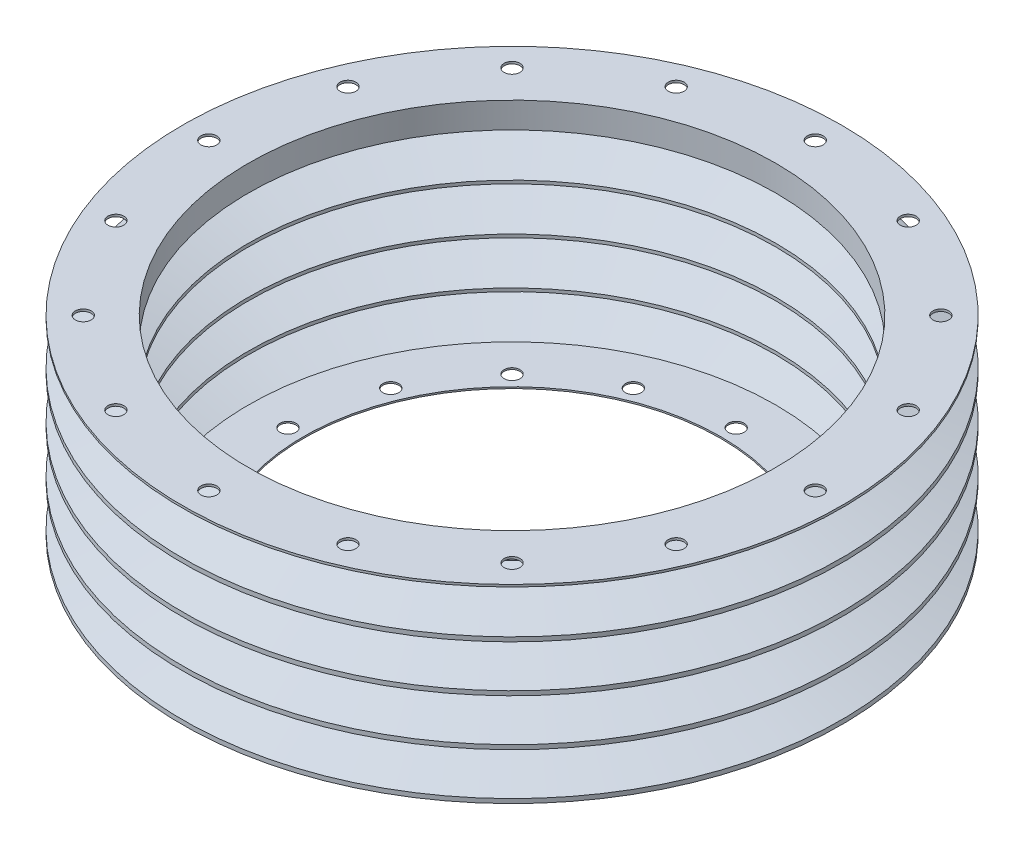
ISO-10303-21;
HEADER;
FILE_DESCRIPTION(('STEP AP214'),'2;1');
FILE_NAME('part.step','',(''),(''),'','','');
FILE_SCHEMA(('AUTOMOTIVE_DESIGN { 1 0 10303 214 1 1 1 1 }'));
ENDSEC;
DATA;
#1=APPLICATION_CONTEXT('core data for automotive mechanical design processes');
#2=APPLICATION_PROTOCOL_DEFINITION('international standard','automotive_design',2000,#1);
#3=PRODUCT_CONTEXT('',#1,'mechanical');
#4=PRODUCT('Part','Part','',(#3));
#5=PRODUCT_RELATED_PRODUCT_CATEGORY('part','',(#4));
#6=PRODUCT_DEFINITION_FORMATION('','',#4);
#7=PRODUCT_DEFINITION_CONTEXT('part definition',#1,'design');
#8=PRODUCT_DEFINITION('design','',#6,#7);
#9=PRODUCT_DEFINITION_SHAPE('','',#8);
#10=(LENGTH_UNIT() NAMED_UNIT(*) SI_UNIT(.MILLI.,.METRE.));
#11=(NAMED_UNIT(*) PLANE_ANGLE_UNIT() SI_UNIT($,.RADIAN.));
#12=(NAMED_UNIT(*) SI_UNIT($,.STERADIAN.) SOLID_ANGLE_UNIT());
#13=UNCERTAINTY_MEASURE_WITH_UNIT(LENGTH_MEASURE(1.E-05),#10,'distance_accuracy_value','');
#14=(GEOMETRIC_REPRESENTATION_CONTEXT(3) GLOBAL_UNCERTAINTY_ASSIGNED_CONTEXT((#13)) GLOBAL_UNIT_ASSIGNED_CONTEXT((#10,
#11,#12)) REPRESENTATION_CONTEXT('',''));
#15=CARTESIAN_POINT('',(0.,0.,0.));
#16=DIRECTION('',(0.,0.,1.));
#17=DIRECTION('',(1.,0.,0.));
#18=AXIS2_PLACEMENT_3D('',#15,#16,#17);
#19=CARTESIAN_POINT('',(-121.016,0.,0.));
#20=DIRECTION('',(0.,1.,0.));
#21=DIRECTION('',(0.,0.,1.));
#22=AXIS2_PLACEMENT_3D('',#19,#20,#21);
#23=PLANE('',#22);
#24=CARTESIAN_POINT('',(-102.,0.,3.56131096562E-13));
#25=DIRECTION('',(0.,-1.,0.));
#26=DIRECTION('',(0.,0.,-1.));
#27=AXIS2_PLACEMENT_3D('',#24,#25,#26);
#28=CIRCLE('',#27,3.60000000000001);
#29=CARTESIAN_POINT('',(-102.,0.,-3.59999999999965));
#30=VERTEX_POINT('',#29);
#31=EDGE_CURVE('E254',#30,#30,#28,.T.);
#32=ORIENTED_EDGE('',*,*,#31,.F.);
#33=EDGE_LOOP('',(#32));
#34=FACE_BOUND('',#33,.T.);
#35=CARTESIAN_POINT('',(-94.2357123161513,0.,-39.0337101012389));
#36=DIRECTION('',(0.,-1.,0.));
#37=DIRECTION('',(0.,0.,-1.));
#38=AXIS2_PLACEMENT_3D('',#35,#36,#37);
#39=CIRCLE('',#38,3.60000000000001);
#40=CARTESIAN_POINT('',(-94.2357123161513,0.,-42.6337101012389));
#41=VERTEX_POINT('',#40);
#42=EDGE_CURVE('E248',#41,#41,#39,.T.);
#43=ORIENTED_EDGE('',*,*,#42,.F.);
#44=EDGE_LOOP('',(#43));
#45=FACE_BOUND('',#44,.T.);
#46=CARTESIAN_POINT('',(-72.124891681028,0.,-72.1248916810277));
#47=DIRECTION('',(0.,-1.,0.));
#48=DIRECTION('',(0.,0.,-1.));
#49=AXIS2_PLACEMENT_3D('',#46,#47,#48);
#50=CIRCLE('',#49,3.60000000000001);
#51=CARTESIAN_POINT('',(-72.124891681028,0.,-75.7248916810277));
#52=VERTEX_POINT('',#51);
#53=EDGE_CURVE('E242',#52,#52,#50,.T.);
#54=ORIENTED_EDGE('',*,*,#53,.F.);
#55=EDGE_LOOP('',(#54));
#56=FACE_BOUND('',#55,.T.);
#57=CARTESIAN_POINT('',(-39.0337101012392,0.,-94.2357123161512));
#58=DIRECTION('',(0.,-1.,0.));
#59=DIRECTION('',(0.,0.,-1.));
#60=AXIS2_PLACEMENT_3D('',#57,#58,#59);
#61=CIRCLE('',#60,3.6);
#62=CARTESIAN_POINT('',(-39.0337101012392,0.,-97.8357123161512));
#63=VERTEX_POINT('',#62);
#64=EDGE_CURVE('E236',#63,#63,#61,.T.);
#65=ORIENTED_EDGE('',*,*,#64,.F.);
#66=EDGE_LOOP('',(#65));
#67=FACE_BOUND('',#66,.T.);
#68=CARTESIAN_POINT('',(0.,0.,0.));
#69=DIRECTION('',(0.,-1.,0.));
#70=DIRECTION('',(0.,0.,-1.));
#71=AXIS2_PLACEMENT_3D('',#68,#69,#70);
#72=CIRCLE('',#71,95.);
#73=CARTESIAN_POINT('',(0.,0.,-95.));
#74=VERTEX_POINT('',#73);
#75=EDGE_CURVE('E125',#74,#74,#72,.T.);
#76=ORIENTED_EDGE('',*,*,#75,.F.);
#77=EDGE_LOOP('',(#76));
#78=FACE_BOUND('',#77,.T.);
#79=CARTESIAN_POINT('',(0.,0.,0.));
#80=DIRECTION('',(0.,-1.,0.));
#81=DIRECTION('',(0.,0.,-1.));
#82=AXIS2_PLACEMENT_3D('',#79,#80,#81);
#83=CIRCLE('',#82,121.016);
#84=CARTESIAN_POINT('',(0.,0.,-121.016));
#85=VERTEX_POINT('',#84);
#86=EDGE_CURVE('E122',#85,#85,#83,.T.);
#87=ORIENTED_EDGE('',*,*,#86,.T.);
#88=EDGE_LOOP('',(#87));
#89=FACE_BOUND('',#88,.T.);
#90=CARTESIAN_POINT('',(0.,0.,-102.));
#91=DIRECTION('',(0.,-1.,0.));
#92=DIRECTION('',(0.,0.,-1.));
#93=AXIS2_PLACEMENT_3D('',#90,#91,#92);
#94=CIRCLE('',#93,3.6);
#95=CARTESIAN_POINT('',(0.,0.,-105.6));
#96=VERTEX_POINT('',#95);
#97=EDGE_CURVE('E140',#96,#96,#94,.T.);
#98=ORIENTED_EDGE('',*,*,#97,.F.);
#99=EDGE_LOOP('',(#98));
#100=FACE_BOUND('',#99,.T.);
#101=CARTESIAN_POINT('',(-94.2357123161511,0.,39.0337101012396));
#102=DIRECTION('',(0.,-1.,0.));
#103=DIRECTION('',(0.,0.,-1.));
#104=AXIS2_PLACEMENT_3D('',#101,#102,#103);
#105=CIRCLE('',#104,3.60000000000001);
#106=CARTESIAN_POINT('',(-94.2357123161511,0.,35.4337101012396));
#107=VERTEX_POINT('',#106);
#108=EDGE_CURVE('E260',#107,#107,#105,.T.);
#109=ORIENTED_EDGE('',*,*,#108,.F.);
#110=EDGE_LOOP('',(#109));
#111=FACE_BOUND('',#110,.T.);
#112=CARTESIAN_POINT('',(-72.1248916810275,0.,72.1248916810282));
#113=DIRECTION('',(0.,-1.,0.));
#114=DIRECTION('',(0.,0.,-1.));
#115=AXIS2_PLACEMENT_3D('',#112,#113,#114);
#116=CIRCLE('',#115,3.60000000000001);
#117=CARTESIAN_POINT('',(-72.1248916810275,0.,68.5248916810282));
#118=VERTEX_POINT('',#117);
#119=EDGE_CURVE('E266',#118,#118,#116,.T.);
#120=ORIENTED_EDGE('',*,*,#119,.F.);
#121=EDGE_LOOP('',(#120));
#122=FACE_BOUND('',#121,.T.);
#123=CARTESIAN_POINT('',(-39.0337101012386,0.,94.2357123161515));
#124=DIRECTION('',(0.,-1.,0.));
#125=DIRECTION('',(0.,0.,-1.));
#126=AXIS2_PLACEMENT_3D('',#123,#124,#125);
#127=CIRCLE('',#126,3.6);
#128=CARTESIAN_POINT('',(-39.0337101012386,0.,90.6357123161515));
#129=VERTEX_POINT('',#128);
#130=EDGE_CURVE('E272',#129,#129,#127,.T.);
#131=ORIENTED_EDGE('',*,*,#130,.F.);
#132=EDGE_LOOP('',(#131));
#133=FACE_BOUND('',#132,.T.);
#134=CARTESIAN_POINT('',(0.,0.,102.));
#135=DIRECTION('',(0.,-1.,0.));
#136=DIRECTION('',(0.,0.,-1.));
#137=AXIS2_PLACEMENT_3D('',#134,#135,#136);
#138=CIRCLE('',#137,3.6);
#139=CARTESIAN_POINT('',(0.,0.,98.4));
#140=VERTEX_POINT('',#139);
#141=EDGE_CURVE('E278',#140,#140,#138,.T.);
#142=ORIENTED_EDGE('',*,*,#141,.F.);
#143=EDGE_LOOP('',(#142));
#144=FACE_BOUND('',#143,.T.);
#145=CARTESIAN_POINT('',(39.0337101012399,0.,94.2357123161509));
#146=DIRECTION('',(0.,-1.,0.));
#147=DIRECTION('',(0.,0.,-1.));
#148=AXIS2_PLACEMENT_3D('',#145,#146,#147);
#149=CIRCLE('',#148,3.6);
#150=CARTESIAN_POINT('',(39.0337101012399,0.,90.6357123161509));
#151=VERTEX_POINT('',#150);
#152=EDGE_CURVE('E284',#151,#151,#149,.T.);
#153=ORIENTED_EDGE('',*,*,#152,.F.);
#154=EDGE_LOOP('',(#153));
#155=FACE_BOUND('',#154,.T.);
#156=CARTESIAN_POINT('',(72.1248916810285,0.,72.1248916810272));
#157=DIRECTION('',(0.,-1.,0.));
#158=DIRECTION('',(0.,0.,-1.));
#159=AXIS2_PLACEMENT_3D('',#156,#157,#158);
#160=CIRCLE('',#159,3.60000000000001);
#161=CARTESIAN_POINT('',(72.1248916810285,0.,68.5248916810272));
#162=VERTEX_POINT('',#161);
#163=EDGE_CURVE('E290',#162,#162,#160,.T.);
#164=ORIENTED_EDGE('',*,*,#163,.F.);
#165=EDGE_LOOP('',(#164));
#166=FACE_BOUND('',#165,.T.);
#167=CARTESIAN_POINT('',(94.2357123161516,0.,39.0337101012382));
#168=DIRECTION('',(0.,-1.,0.));
#169=DIRECTION('',(0.,0.,-1.));
#170=AXIS2_PLACEMENT_3D('',#167,#168,#169);
#171=CIRCLE('',#170,3.60000000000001);
#172=CARTESIAN_POINT('',(94.2357123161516,0.,35.4337101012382));
#173=VERTEX_POINT('',#172);
#174=EDGE_CURVE('E296',#173,#173,#171,.T.);
#175=ORIENTED_EDGE('',*,*,#174,.F.);
#176=EDGE_LOOP('',(#175));
#177=FACE_BOUND('',#176,.T.);
#178=CARTESIAN_POINT('',(102.,0.,-1.068393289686E-12));
#179=DIRECTION('',(0.,-1.,0.));
#180=DIRECTION('',(0.,0.,-1.));
#181=AXIS2_PLACEMENT_3D('',#178,#179,#180);
#182=CIRCLE('',#181,3.60000000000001);
#183=CARTESIAN_POINT('',(102.,0.,-3.60000000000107));
#184=VERTEX_POINT('',#183);
#185=EDGE_CURVE('E302',#184,#184,#182,.T.);
#186=ORIENTED_EDGE('',*,*,#185,.F.);
#187=EDGE_LOOP('',(#186));
#188=FACE_BOUND('',#187,.T.);
#189=CARTESIAN_POINT('',(94.2357123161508,0.,-39.0337101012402));
#190=DIRECTION('',(0.,-1.,0.));
#191=DIRECTION('',(0.,0.,-1.));
#192=AXIS2_PLACEMENT_3D('',#189,#190,#191);
#193=CIRCLE('',#192,3.60000000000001);
#194=CARTESIAN_POINT('',(94.2357123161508,0.,-42.6337101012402));
#195=VERTEX_POINT('',#194);
#196=EDGE_CURVE('E308',#195,#195,#193,.T.);
#197=ORIENTED_EDGE('',*,*,#196,.F.);
#198=EDGE_LOOP('',(#197));
#199=FACE_BOUND('',#198,.T.);
#200=CARTESIAN_POINT('',(72.124891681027,0.,-72.1248916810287));
#201=DIRECTION('',(0.,-1.,0.));
#202=DIRECTION('',(0.,0.,-1.));
#203=AXIS2_PLACEMENT_3D('',#200,#201,#202);
#204=CIRCLE('',#203,3.60000000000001);
#205=CARTESIAN_POINT('',(72.124891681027,0.,-75.7248916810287));
#206=VERTEX_POINT('',#205);
#207=EDGE_CURVE('E314',#206,#206,#204,.T.);
#208=ORIENTED_EDGE('',*,*,#207,.F.);
#209=EDGE_LOOP('',(#208));
#210=FACE_BOUND('',#209,.T.);
#211=CARTESIAN_POINT('',(39.0337101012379,0.,-94.2357123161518));
#212=DIRECTION('',(0.,-1.,0.));
#213=DIRECTION('',(0.,0.,-1.));
#214=AXIS2_PLACEMENT_3D('',#211,#212,#213);
#215=CIRCLE('',#214,3.6);
#216=CARTESIAN_POINT('',(39.0337101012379,0.,-97.8357123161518));
#217=VERTEX_POINT('',#216);
#218=EDGE_CURVE('E320',#217,#217,#215,.T.);
#219=ORIENTED_EDGE('',*,*,#218,.F.);
#220=EDGE_LOOP('',(#219));
#221=FACE_BOUND('',#220,.T.);
#222=ADVANCED_FACE('F30',(#34,#45,#56,#67,#78,#89,#100,#111,#122,#133,#144,#155,#166,#177,#188,
#199,#210,#221),#23,.F.);
#223=CARTESIAN_POINT('',(-120.,96.016,0.));
#224=DIRECTION('',(0.,-1.,0.));
#225=DIRECTION('',(0.,0.,-1.));
#226=AXIS2_PLACEMENT_3D('',#223,#224,#225);
#227=PLANE('',#226);
#228=CARTESIAN_POINT('',(52.8103136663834,96.016,127.495375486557));
#229=DIRECTION('',(0.,1.,0.));
#230=DIRECTION('',(0.,0.,1.));
#231=AXIS2_PLACEMENT_3D('',#228,#229,#230);
#232=CIRCLE('',#231,3.6);
#233=CARTESIAN_POINT('',(52.8103136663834,96.016,131.095375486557));
#234=VERTEX_POINT('',#233);
#235=EDGE_CURVE('E170',#234,#234,#232,.T.);
#236=ORIENTED_EDGE('',*,*,#235,.F.);
#237=EDGE_LOOP('',(#236));
#238=FACE_BOUND('',#237,.T.);
#239=CARTESIAN_POINT('',(9.53669210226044E-13,96.016,138.));
#240=DIRECTION('',(0.,1.,0.));
#241=DIRECTION('',(0.,0.,1.));
#242=AXIS2_PLACEMENT_3D('',#239,#240,#241);
#243=CIRCLE('',#242,3.6);
#244=CARTESIAN_POINT('',(9.53669210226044E-13,96.016,141.6));
#245=VERTEX_POINT('',#244);
#246=EDGE_CURVE('E164',#245,#245,#243,.T.);
#247=ORIENTED_EDGE('',*,*,#246,.F.);
#248=EDGE_LOOP('',(#247));
#249=FACE_BOUND('',#248,.T.);
#250=CARTESIAN_POINT('',(-52.8103136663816,96.016,127.495375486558));
#251=DIRECTION('',(0.,1.,0.));
#252=DIRECTION('',(0.,0.,1.));
#253=AXIS2_PLACEMENT_3D('',#250,#251,#252);
#254=CIRCLE('',#253,3.6);
#255=CARTESIAN_POINT('',(-52.8103136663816,96.016,131.095375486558));
#256=VERTEX_POINT('',#255);
#257=EDGE_CURVE('E158',#256,#256,#254,.T.);
#258=ORIENTED_EDGE('',*,*,#257,.F.);
#259=EDGE_LOOP('',(#258));
#260=FACE_BOUND('',#259,.T.);
#261=CARTESIAN_POINT('',(-97.5807358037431,96.016,97.5807358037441));
#262=DIRECTION('',(0.,1.,0.));
#263=DIRECTION('',(0.,0.,1.));
#264=AXIS2_PLACEMENT_3D('',#261,#262,#263);
#265=CIRCLE('',#264,3.60000000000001);
#266=CARTESIAN_POINT('',(-97.5807358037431,96.016,101.180735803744));
#267=VERTEX_POINT('',#266);
#268=EDGE_CURVE('E152',#267,#267,#265,.T.);
#269=ORIENTED_EDGE('',*,*,#268,.F.);
#270=EDGE_LOOP('',(#269));
#271=FACE_BOUND('',#270,.T.);
#272=CARTESIAN_POINT('',(-127.495375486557,96.016,52.810313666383));
#273=DIRECTION('',(0.,1.,0.));
#274=DIRECTION('',(0.,0.,1.));
#275=AXIS2_PLACEMENT_3D('',#272,#273,#274);
#276=CIRCLE('',#275,3.60000000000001);
#277=CARTESIAN_POINT('',(-127.495375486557,96.016,56.410313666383));
#278=VERTEX_POINT('',#277);
#279=EDGE_CURVE('E146',#278,#278,#276,.T.);
#280=ORIENTED_EDGE('',*,*,#279,.F.);
#281=EDGE_LOOP('',(#280));
#282=FACE_BOUND('',#281,.T.);
#283=CARTESIAN_POINT('',(-138.,96.016,4.71844785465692E-13));
#284=DIRECTION('',(0.,1.,0.));
#285=DIRECTION('',(0.,0.,1.));
#286=AXIS2_PLACEMENT_3D('',#283,#284,#285);
#287=CIRCLE('',#286,3.59999999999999);
#288=CARTESIAN_POINT('',(-138.,96.016,3.60000000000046));
#289=VERTEX_POINT('',#288);
#290=EDGE_CURVE('E134',#289,#289,#287,.T.);
#291=ORIENTED_EDGE('',*,*,#290,.F.);
#292=EDGE_LOOP('',(#291));
#293=FACE_BOUND('',#292,.T.);
#294=CARTESIAN_POINT('',(0.,96.016,0.));
#295=DIRECTION('',(0.,-1.,0.));
#296=DIRECTION('',(0.,0.,-1.));
#297=AXIS2_PLACEMENT_3D('',#294,#295,#296);
#298=CIRCLE('',#297,150.);
#299=CARTESIAN_POINT('',(0.,96.016,-150.));
#300=VERTEX_POINT('',#299);
#301=EDGE_CURVE('E77',#300,#300,#298,.T.);
#302=ORIENTED_EDGE('',*,*,#301,.F.);
#303=EDGE_LOOP('',(#302));
#304=FACE_BOUND('',#303,.T.);
#305=CARTESIAN_POINT('',(0.,96.016,0.));
#306=DIRECTION('',(0.,-1.,0.));
#307=DIRECTION('',(0.,0.,-1.));
#308=AXIS2_PLACEMENT_3D('',#305,#306,#307);
#309=CIRCLE('',#308,120.);
#310=CARTESIAN_POINT('',(0.,96.016,-120.));
#311=VERTEX_POINT('',#310);
#312=EDGE_CURVE('E74',#311,#311,#309,.T.);
#313=ORIENTED_EDGE('',*,*,#312,.T.);
#314=EDGE_LOOP('',(#313));
#315=FACE_BOUND('',#314,.T.);
#316=CARTESIAN_POINT('',(97.5807358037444,96.016,97.5807358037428));
#317=DIRECTION('',(0.,1.,0.));
#318=DIRECTION('',(0.,0.,1.));
#319=AXIS2_PLACEMENT_3D('',#316,#317,#318);
#320=CIRCLE('',#319,3.60000000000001);
#321=CARTESIAN_POINT('',(97.5807358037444,96.016,101.180735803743));
#322=VERTEX_POINT('',#321);
#323=EDGE_CURVE('E176',#322,#322,#320,.T.);
#324=ORIENTED_EDGE('',*,*,#323,.F.);
#325=EDGE_LOOP('',(#324));
#326=FACE_BOUND('',#325,.T.);
#327=CARTESIAN_POINT('',(127.495375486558,96.016,52.8103136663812));
#328=DIRECTION('',(0.,1.,0.));
#329=DIRECTION('',(0.,0.,1.));
#330=AXIS2_PLACEMENT_3D('',#327,#328,#329);
#331=CIRCLE('',#330,3.59999999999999);
#332=CARTESIAN_POINT('',(127.495375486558,96.016,56.4103136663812));
#333=VERTEX_POINT('',#332);
#334=EDGE_CURVE('E182',#333,#333,#331,.T.);
#335=ORIENTED_EDGE('',*,*,#334,.F.);
#336=EDGE_LOOP('',(#335));
#337=FACE_BOUND('',#336,.T.);
#338=CARTESIAN_POINT('',(138.,96.016,-4.71844785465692E-13));
#339=DIRECTION('',(0.,1.,0.));
#340=DIRECTION('',(0.,0.,1.));
#341=AXIS2_PLACEMENT_3D('',#338,#339,#340);
#342=CIRCLE('',#341,3.59999999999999);
#343=CARTESIAN_POINT('',(138.,96.016,3.59999999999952));
#344=VERTEX_POINT('',#343);
#345=EDGE_CURVE('E188',#344,#344,#342,.T.);
#346=ORIENTED_EDGE('',*,*,#345,.F.);
#347=EDGE_LOOP('',(#346));
#348=FACE_BOUND('',#347,.T.);
#349=CARTESIAN_POINT('',(127.495375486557,96.016,-52.8103136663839));
#350=DIRECTION('',(0.,1.,0.));
#351=DIRECTION('',(0.,0.,1.));
#352=AXIS2_PLACEMENT_3D('',#349,#350,#351);
#353=CIRCLE('',#352,3.59999999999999);
#354=CARTESIAN_POINT('',(127.495375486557,96.016,-49.2103136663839));
#355=VERTEX_POINT('',#354);
#356=EDGE_CURVE('E194',#355,#355,#353,.T.);
#357=ORIENTED_EDGE('',*,*,#356,.F.);
#358=EDGE_LOOP('',(#357));
#359=FACE_BOUND('',#358,.T.);
#360=CARTESIAN_POINT('',(97.5807358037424,96.016,-97.5807358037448));
#361=DIRECTION('',(0.,1.,0.));
#362=DIRECTION('',(0.,0.,1.));
#363=AXIS2_PLACEMENT_3D('',#360,#361,#362);
#364=CIRCLE('',#363,3.60000000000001);
#365=CARTESIAN_POINT('',(97.5807358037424,96.016,-93.9807358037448));
#366=VERTEX_POINT('',#365);
#367=EDGE_CURVE('E200',#366,#366,#364,.T.);
#368=ORIENTED_EDGE('',*,*,#367,.F.);
#369=EDGE_LOOP('',(#368));
#370=FACE_BOUND('',#369,.T.);
#371=CARTESIAN_POINT('',(52.8103136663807,96.016,-127.495375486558));
#372=DIRECTION('',(0.,1.,0.));
#373=DIRECTION('',(0.,0.,1.));
#374=AXIS2_PLACEMENT_3D('',#371,#372,#373);
#375=CIRCLE('',#374,3.6);
#376=CARTESIAN_POINT('',(52.8103136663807,96.016,-123.895375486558));
#377=VERTEX_POINT('',#376);
#378=EDGE_CURVE('E206',#377,#377,#375,.T.);
#379=ORIENTED_EDGE('',*,*,#378,.F.);
#380=EDGE_LOOP('',(#379));
#381=FACE_BOUND('',#380,.T.);
#382=CARTESIAN_POINT('',(-1.91731805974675E-12,96.016,-138.));
#383=DIRECTION('',(0.,1.,0.));
#384=DIRECTION('',(0.,0.,1.));
#385=AXIS2_PLACEMENT_3D('',#382,#383,#384);
#386=CIRCLE('',#385,3.6);
#387=CARTESIAN_POINT('',(-1.91731805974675E-12,96.016,-134.4));
#388=VERTEX_POINT('',#387);
#389=EDGE_CURVE('E212',#388,#388,#386,.T.);
#390=ORIENTED_EDGE('',*,*,#389,.F.);
#391=EDGE_LOOP('',(#390));
#392=FACE_BOUND('',#391,.T.);
#393=CARTESIAN_POINT('',(-52.8103136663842,96.016,-127.495375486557));
#394=DIRECTION('',(0.,1.,0.));
#395=DIRECTION('',(0.,0.,1.));
#396=AXIS2_PLACEMENT_3D('',#393,#394,#395);
#397=CIRCLE('',#396,3.6);
#398=CARTESIAN_POINT('',(-52.8103136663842,96.016,-123.895375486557));
#399=VERTEX_POINT('',#398);
#400=EDGE_CURVE('E218',#399,#399,#397,.T.);
#401=ORIENTED_EDGE('',*,*,#400,.F.);
#402=EDGE_LOOP('',(#401));
#403=FACE_BOUND('',#402,.T.);
#404=CARTESIAN_POINT('',(-97.5807358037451,96.016,-97.5807358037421));
#405=DIRECTION('',(0.,1.,0.));
#406=DIRECTION('',(0.,0.,1.));
#407=AXIS2_PLACEMENT_3D('',#404,#405,#406);
#408=CIRCLE('',#407,3.60000000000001);
#409=CARTESIAN_POINT('',(-97.5807358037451,96.016,-93.9807358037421));
#410=VERTEX_POINT('',#409);
#411=EDGE_CURVE('E224',#410,#410,#408,.T.);
#412=ORIENTED_EDGE('',*,*,#411,.F.);
#413=EDGE_LOOP('',(#412));
#414=FACE_BOUND('',#413,.T.);
#415=CARTESIAN_POINT('',(-127.495375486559,96.016,-52.8103136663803));
#416=DIRECTION('',(0.,1.,0.));
#417=DIRECTION('',(0.,0.,1.));
#418=AXIS2_PLACEMENT_3D('',#415,#416,#417);
#419=CIRCLE('',#418,3.60000000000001);
#420=CARTESIAN_POINT('',(-127.495375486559,96.016,-49.2103136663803));
#421=VERTEX_POINT('',#420);
#422=EDGE_CURVE('E230',#421,#421,#419,.T.);
#423=ORIENTED_EDGE('',*,*,#422,.F.);
#424=EDGE_LOOP('',(#423));
#425=FACE_BOUND('',#424,.T.);
#426=ADVANCED_FACE('F327',(#238,#249,#260,#271,#282,#293,#304,#315,#326,#337,#348,#359,#370,
#381,#392,#403,#414,#425),#227,.F.);
#427=CARTESIAN_POINT('',(-95.,0.732937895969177,0.));
#428=DIRECTION('',(0.,-1.,0.));
#429=DIRECTION('',(0.,0.,-1.));
#430=AXIS2_PLACEMENT_3D('',#427,#428,#429);
#431=PLANE('',#430);
#432=CARTESIAN_POINT('',(39.0337101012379,0.732937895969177,-94.2357123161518));
#433=DIRECTION('',(0.,-1.,0.));
#434=DIRECTION('',(0.,0.,-1.));
#435=AXIS2_PLACEMENT_3D('',#432,#433,#434);
#436=CIRCLE('',#435,3.6);
#437=CARTESIAN_POINT('',(39.0337101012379,0.732937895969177,-97.8357123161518));
#438=VERTEX_POINT('',#437);
#439=EDGE_CURVE('E317',#438,#438,#436,.T.);
#440=ORIENTED_EDGE('',*,*,#439,.T.);
#441=EDGE_LOOP('',(#440));
#442=FACE_BOUND('',#441,.T.);
#443=CARTESIAN_POINT('',(72.124891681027,0.732937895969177,-72.1248916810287));
#444=DIRECTION('',(0.,-1.,0.));
#445=DIRECTION('',(0.,0.,-1.));
#446=AXIS2_PLACEMENT_3D('',#443,#444,#445);
#447=CIRCLE('',#446,3.60000000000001);
#448=CARTESIAN_POINT('',(72.124891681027,0.732937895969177,-75.7248916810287));
#449=VERTEX_POINT('',#448);
#450=EDGE_CURVE('E311',#449,#449,#447,.T.);
#451=ORIENTED_EDGE('',*,*,#450,.T.);
#452=EDGE_LOOP('',(#451));
#453=FACE_BOUND('',#452,.T.);
#454=CARTESIAN_POINT('',(94.2357123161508,0.732937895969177,-39.0337101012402));
#455=DIRECTION('',(0.,-1.,0.));
#456=DIRECTION('',(0.,0.,-1.));
#457=AXIS2_PLACEMENT_3D('',#454,#455,#456);
#458=CIRCLE('',#457,3.60000000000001);
#459=CARTESIAN_POINT('',(94.2357123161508,0.732937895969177,-42.6337101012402));
#460=VERTEX_POINT('',#459);
#461=EDGE_CURVE('E305',#460,#460,#458,.T.);
#462=ORIENTED_EDGE('',*,*,#461,.T.);
#463=EDGE_LOOP('',(#462));
#464=FACE_BOUND('',#463,.T.);
#465=CARTESIAN_POINT('',(102.,0.732937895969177,-1.068393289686E-12));
#466=DIRECTION('',(0.,-1.,0.));
#467=DIRECTION('',(0.,0.,-1.));
#468=AXIS2_PLACEMENT_3D('',#465,#466,#467);
#469=CIRCLE('',#468,3.60000000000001);
#470=CARTESIAN_POINT('',(102.,0.732937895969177,-3.60000000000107));
#471=VERTEX_POINT('',#470);
#472=EDGE_CURVE('E299',#471,#471,#469,.T.);
#473=ORIENTED_EDGE('',*,*,#472,.T.);
#474=EDGE_LOOP('',(#473));
#475=FACE_BOUND('',#474,.T.);
#476=CARTESIAN_POINT('',(94.2357123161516,0.732937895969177,39.0337101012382));
#477=DIRECTION('',(0.,-1.,0.));
#478=DIRECTION('',(0.,0.,-1.));
#479=AXIS2_PLACEMENT_3D('',#476,#477,#478);
#480=CIRCLE('',#479,3.60000000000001);
#481=CARTESIAN_POINT('',(94.2357123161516,0.732937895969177,35.4337101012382));
#482=VERTEX_POINT('',#481);
#483=EDGE_CURVE('E293',#482,#482,#480,.T.);
#484=ORIENTED_EDGE('',*,*,#483,.T.);
#485=EDGE_LOOP('',(#484));
#486=FACE_BOUND('',#485,.T.);
#487=CARTESIAN_POINT('',(72.1248916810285,0.732937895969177,72.1248916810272));
#488=DIRECTION('',(0.,-1.,0.));
#489=DIRECTION('',(0.,0.,-1.));
#490=AXIS2_PLACEMENT_3D('',#487,#488,#489);
#491=CIRCLE('',#490,3.60000000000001);
#492=CARTESIAN_POINT('',(72.1248916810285,0.732937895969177,68.5248916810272));
#493=VERTEX_POINT('',#492);
#494=EDGE_CURVE('E287',#493,#493,#491,.T.);
#495=ORIENTED_EDGE('',*,*,#494,.T.);
#496=EDGE_LOOP('',(#495));
#497=FACE_BOUND('',#496,.T.);
#498=CARTESIAN_POINT('',(39.0337101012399,0.732937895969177,94.2357123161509));
#499=DIRECTION('',(0.,-1.,0.));
#500=DIRECTION('',(0.,0.,-1.));
#501=AXIS2_PLACEMENT_3D('',#498,#499,#500);
#502=CIRCLE('',#501,3.6);
#503=CARTESIAN_POINT('',(39.0337101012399,0.732937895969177,90.6357123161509));
#504=VERTEX_POINT('',#503);
#505=EDGE_CURVE('E281',#504,#504,#502,.T.);
#506=ORIENTED_EDGE('',*,*,#505,.T.);
#507=EDGE_LOOP('',(#506));
#508=FACE_BOUND('',#507,.T.);
#509=CARTESIAN_POINT('',(0.,0.732937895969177,102.));
#510=DIRECTION('',(0.,-1.,0.));
#511=DIRECTION('',(0.,0.,-1.));
#512=AXIS2_PLACEMENT_3D('',#509,#510,#511);
#513=CIRCLE('',#512,3.6);
#514=CARTESIAN_POINT('',(0.,0.732937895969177,98.4));
#515=VERTEX_POINT('',#514);
#516=EDGE_CURVE('E275',#515,#515,#513,.T.);
#517=ORIENTED_EDGE('',*,*,#516,.T.);
#518=EDGE_LOOP('',(#517));
#519=FACE_BOUND('',#518,.T.);
#520=CARTESIAN_POINT('',(-39.0337101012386,0.732937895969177,94.2357123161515));
#521=DIRECTION('',(0.,-1.,0.));
#522=DIRECTION('',(0.,0.,-1.));
#523=AXIS2_PLACEMENT_3D('',#520,#521,#522);
#524=CIRCLE('',#523,3.6);
#525=CARTESIAN_POINT('',(-39.0337101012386,0.732937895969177,90.6357123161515));
#526=VERTEX_POINT('',#525);
#527=EDGE_CURVE('E269',#526,#526,#524,.T.);
#528=ORIENTED_EDGE('',*,*,#527,.T.);
#529=EDGE_LOOP('',(#528));
#530=FACE_BOUND('',#529,.T.);
#531=CARTESIAN_POINT('',(-72.1248916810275,0.732937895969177,72.1248916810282));
#532=DIRECTION('',(0.,-1.,0.));
#533=DIRECTION('',(0.,0.,-1.));
#534=AXIS2_PLACEMENT_3D('',#531,#532,#533);
#535=CIRCLE('',#534,3.60000000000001);
#536=CARTESIAN_POINT('',(-72.1248916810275,0.732937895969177,68.5248916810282));
#537=VERTEX_POINT('',#536);
#538=EDGE_CURVE('E263',#537,#537,#535,.T.);
#539=ORIENTED_EDGE('',*,*,#538,.T.);
#540=EDGE_LOOP('',(#539));
#541=FACE_BOUND('',#540,.T.);
#542=CARTESIAN_POINT('',(-94.2357123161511,0.732937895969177,39.0337101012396));
#543=DIRECTION('',(0.,-1.,0.));
#544=DIRECTION('',(0.,0.,-1.));
#545=AXIS2_PLACEMENT_3D('',#542,#543,#544);
#546=CIRCLE('',#545,3.60000000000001);
#547=CARTESIAN_POINT('',(-94.2357123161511,0.732937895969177,35.4337101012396));
#548=VERTEX_POINT('',#547);
#549=EDGE_CURVE('E257',#548,#548,#546,.T.);
#550=ORIENTED_EDGE('',*,*,#549,.T.);
#551=EDGE_LOOP('',(#550));
#552=FACE_BOUND('',#551,.T.);
#553=CARTESIAN_POINT('',(-102.,0.732937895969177,3.56131096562E-13));
#554=DIRECTION('',(0.,-1.,0.));
#555=DIRECTION('',(0.,0.,-1.));
#556=AXIS2_PLACEMENT_3D('',#553,#554,#555);
#557=CIRCLE('',#556,3.60000000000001);
#558=CARTESIAN_POINT('',(-102.,0.732937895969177,-3.59999999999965));
#559=VERTEX_POINT('',#558);
#560=EDGE_CURVE('E251',#559,#559,#557,.T.);
#561=ORIENTED_EDGE('',*,*,#560,.T.);
#562=EDGE_LOOP('',(#561));
#563=FACE_BOUND('',#562,.T.);
#564=CARTESIAN_POINT('',(-94.2357123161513,0.732937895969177,-39.0337101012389));
#565=DIRECTION('',(0.,-1.,0.));
#566=DIRECTION('',(0.,0.,-1.));
#567=AXIS2_PLACEMENT_3D('',#564,#565,#566);
#568=CIRCLE('',#567,3.60000000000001);
#569=CARTESIAN_POINT('',(-94.2357123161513,0.732937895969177,-42.6337101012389));
#570=VERTEX_POINT('',#569);
#571=EDGE_CURVE('E245',#570,#570,#568,.T.);
#572=ORIENTED_EDGE('',*,*,#571,.T.);
#573=EDGE_LOOP('',(#572));
#574=FACE_BOUND('',#573,.T.);
#575=CARTESIAN_POINT('',(-72.124891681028,0.732937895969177,-72.1248916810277));
#576=DIRECTION('',(0.,-1.,0.));
#577=DIRECTION('',(0.,0.,-1.));
#578=AXIS2_PLACEMENT_3D('',#575,#576,#577);
#579=CIRCLE('',#578,3.60000000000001);
#580=CARTESIAN_POINT('',(-72.124891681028,0.732937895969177,-75.7248916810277));
#581=VERTEX_POINT('',#580);
#582=EDGE_CURVE('E239',#581,#581,#579,.T.);
#583=ORIENTED_EDGE('',*,*,#582,.T.);
#584=EDGE_LOOP('',(#583));
#585=FACE_BOUND('',#584,.T.);
#586=CARTESIAN_POINT('',(-39.0337101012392,0.732937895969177,-94.2357123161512));
#587=DIRECTION('',(0.,-1.,0.));
#588=DIRECTION('',(0.,0.,-1.));
#589=AXIS2_PLACEMENT_3D('',#586,#587,#588);
#590=CIRCLE('',#589,3.6);
#591=CARTESIAN_POINT('',(-39.0337101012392,0.732937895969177,-97.8357123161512));
#592=VERTEX_POINT('',#591);
#593=EDGE_CURVE('E233',#592,#592,#590,.T.);
#594=ORIENTED_EDGE('',*,*,#593,.T.);
#595=EDGE_LOOP('',(#594));
#596=FACE_BOUND('',#595,.T.);
#597=CARTESIAN_POINT('',(0.,0.732937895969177,-102.));
#598=DIRECTION('',(0.,-1.,0.));
#599=DIRECTION('',(0.,0.,-1.));
#600=AXIS2_PLACEMENT_3D('',#597,#598,#599);
#601=CIRCLE('',#600,3.6);
#602=CARTESIAN_POINT('',(0.,0.732937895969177,-105.6));
#603=VERTEX_POINT('',#602);
#604=EDGE_CURVE('E137',#603,#603,#601,.T.);
#605=ORIENTED_EDGE('',*,*,#604,.T.);
#606=EDGE_LOOP('',(#605));
#607=FACE_BOUND('',#606,.T.);
#608=CARTESIAN_POINT('',(0.,0.732937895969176,0.));
#609=DIRECTION('',(0.,-1.,0.));
#610=DIRECTION('',(0.,0.,-1.));
#611=AXIS2_PLACEMENT_3D('',#608,#609,#610);
#612=CIRCLE('',#611,120.);
#613=CARTESIAN_POINT('',(0.,0.732937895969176,-120.));
#614=VERTEX_POINT('',#613);
#615=EDGE_CURVE('E10',#614,#614,#612,.T.);
#616=ORIENTED_EDGE('',*,*,#615,.F.);
#617=EDGE_LOOP('',(#616));
#618=FACE_BOUND('',#617,.T.);
#619=CARTESIAN_POINT('',(0.,0.732937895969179,0.));
#620=DIRECTION('',(0.,-1.,0.));
#621=DIRECTION('',(0.,0.,-1.));
#622=AXIS2_PLACEMENT_3D('',#619,#620,#621);
#623=CIRCLE('',#622,95.);
#624=CARTESIAN_POINT('',(0.,0.732937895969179,-95.));
#625=VERTEX_POINT('',#624);
#626=EDGE_CURVE('E128',#625,#625,#623,.T.);
#627=ORIENTED_EDGE('',*,*,#626,.T.);
#628=EDGE_LOOP('',(#627));
#629=FACE_BOUND('',#628,.T.);
#630=ADVANCED_FACE('F32',(#442,#453,#464,#475,#486,#497,#508,#519,#530,#541,#552,#563,#574,#585,
#596,#607,#618,#629),#431,.F.);
#631=CARTESIAN_POINT('',(0.,0.732937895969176,0.));
#632=DIRECTION('',(0.,1.,0.));
#633=DIRECTION('',(0.,0.,1.));
#634=AXIS2_PLACEMENT_3D('',#631,#632,#633);
#635=CONICAL_SURFACE('',#634,120.,1.24988309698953);
#636=CARTESIAN_POINT('',(0.,10.625,0.));
#637=DIRECTION('',(0.,-1.,0.));
#638=DIRECTION('',(0.,0.,-1.));
#639=AXIS2_PLACEMENT_3D('',#636,#637,#638);
#640=CIRCLE('',#639,149.759223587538);
#641=CARTESIAN_POINT('',(0.,10.625,-149.759223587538));
#642=VERTEX_POINT('',#641);
#643=EDGE_CURVE('E37',#642,#642,#640,.T.);
#644=ORIENTED_EDGE('',*,*,#643,.F.);
#645=EDGE_LOOP('',(#644));
#646=FACE_BOUND('',#645,.T.);
#647=ORIENTED_EDGE('',*,*,#615,.T.);
#648=EDGE_LOOP('',(#647));
#649=FACE_BOUND('',#648,.T.);
#650=ADVANCED_FACE('F443',(#646,#649),#635,.F.);
#651=CARTESIAN_POINT('',(0.,10.625,0.));
#652=DIRECTION('',(0.,-1.,0.));
#653=DIRECTION('',(0.,0.,-1.));
#654=AXIS2_PLACEMENT_3D('',#651,#652,#653);
#655=CONICAL_SURFACE('',#654,149.759223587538,1.24988309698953);
#656=CARTESIAN_POINT('',(0.,20.5170621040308,0.));
#657=DIRECTION('',(0.,-1.,0.));
#658=DIRECTION('',(0.,0.,-1.));
#659=AXIS2_PLACEMENT_3D('',#656,#657,#658);
#660=CIRCLE('',#659,120.);
#661=CARTESIAN_POINT('',(0.,20.5170621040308,-120.));
#662=VERTEX_POINT('',#661);
#663=EDGE_CURVE('E41',#662,#662,#660,.T.);
#664=ORIENTED_EDGE('',*,*,#663,.F.);
#665=EDGE_LOOP('',(#664));
#666=FACE_BOUND('',#665,.T.);
#667=ORIENTED_EDGE('',*,*,#643,.T.);
#668=EDGE_LOOP('',(#667));
#669=FACE_BOUND('',#668,.T.);
#670=ADVANCED_FACE('F440',(#666,#669),#655,.F.);
#671=CARTESIAN_POINT('',(0.,0.,0.));
#672=DIRECTION('',(0.,-1.,0.));
#673=DIRECTION('',(0.,0.,-1.));
#674=AXIS2_PLACEMENT_3D('',#671,#672,#673);
#675=CYLINDRICAL_SURFACE('',#674,120.);
#676=CARTESIAN_POINT('',(0.,21.9829378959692,0.));
#677=DIRECTION('',(0.,-1.,0.));
#678=DIRECTION('',(0.,0.,-1.));
#679=AXIS2_PLACEMENT_3D('',#676,#677,#678);
#680=CIRCLE('',#679,120.);
#681=CARTESIAN_POINT('',(0.,21.9829378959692,-120.));
#682=VERTEX_POINT('',#681);
#683=EDGE_CURVE('E45',#682,#682,#680,.T.);
#684=ORIENTED_EDGE('',*,*,#683,.F.);
#685=EDGE_LOOP('',(#684));
#686=FACE_BOUND('',#685,.T.);
#687=ORIENTED_EDGE('',*,*,#663,.T.);
#688=EDGE_LOOP('',(#687));
#689=FACE_BOUND('',#688,.T.);
#690=ADVANCED_FACE('F436',(#686,#689),#675,.F.);
#691=CARTESIAN_POINT('',(0.,21.9829378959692,0.));
#692=DIRECTION('',(0.,1.,0.));
#693=DIRECTION('',(0.,0.,1.));
#694=AXIS2_PLACEMENT_3D('',#691,#692,#693);
#695=CONICAL_SURFACE('',#694,120.,1.24988309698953);
#696=CARTESIAN_POINT('',(0.,31.875,0.));
#697=DIRECTION('',(0.,-1.,0.));
#698=DIRECTION('',(0.,0.,-1.));
#699=AXIS2_PLACEMENT_3D('',#696,#697,#698);
#700=CIRCLE('',#699,149.759223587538);
#701=CARTESIAN_POINT('',(0.,31.875,-149.759223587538));
#702=VERTEX_POINT('',#701);
#703=EDGE_CURVE('E50',#702,#702,#700,.T.);
#704=ORIENTED_EDGE('',*,*,#703,.F.);
#705=EDGE_LOOP('',(#704));
#706=FACE_BOUND('',#705,.T.);
#707=ORIENTED_EDGE('',*,*,#683,.T.);
#708=EDGE_LOOP('',(#707));
#709=FACE_BOUND('',#708,.T.);
#710=ADVANCED_FACE('F432',(#706,#709),#695,.F.);
#711=CARTESIAN_POINT('',(0.,31.875,0.));
#712=DIRECTION('',(0.,-1.,0.));
#713=DIRECTION('',(0.,0.,-1.));
#714=AXIS2_PLACEMENT_3D('',#711,#712,#713);
#715=CONICAL_SURFACE('',#714,149.759223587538,1.24988309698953);
#716=CARTESIAN_POINT('',(0.,41.7670621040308,0.));
#717=DIRECTION('',(0.,-1.,0.));
#718=DIRECTION('',(0.,0.,-1.));
#719=AXIS2_PLACEMENT_3D('',#716,#717,#718);
#720=CIRCLE('',#719,120.);
#721=CARTESIAN_POINT('',(0.,41.7670621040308,-120.));
#722=VERTEX_POINT('',#721);
#723=EDGE_CURVE('E53',#722,#722,#720,.T.);
#724=ORIENTED_EDGE('',*,*,#723,.F.);
#725=EDGE_LOOP('',(#724));
#726=FACE_BOUND('',#725,.T.);
#727=ORIENTED_EDGE('',*,*,#703,.T.);
#728=EDGE_LOOP('',(#727));
#729=FACE_BOUND('',#728,.T.);
#730=ADVANCED_FACE('F428',(#726,#729),#715,.F.);
#731=CARTESIAN_POINT('',(0.,0.,0.));
#732=DIRECTION('',(0.,-1.,0.));
#733=DIRECTION('',(0.,0.,-1.));
#734=AXIS2_PLACEMENT_3D('',#731,#732,#733);
#735=CYLINDRICAL_SURFACE('',#734,120.);
#736=CARTESIAN_POINT('',(0.,43.2329378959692,0.));
#737=DIRECTION('',(0.,-1.,0.));
#738=DIRECTION('',(0.,0.,-1.));
#739=AXIS2_PLACEMENT_3D('',#736,#737,#738);
#740=CIRCLE('',#739,120.);
#741=CARTESIAN_POINT('',(0.,43.2329378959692,-120.));
#742=VERTEX_POINT('',#741);
#743=EDGE_CURVE('E56',#742,#742,#740,.T.);
#744=ORIENTED_EDGE('',*,*,#743,.F.);
#745=EDGE_LOOP('',(#744));
#746=FACE_BOUND('',#745,.T.);
#747=ORIENTED_EDGE('',*,*,#723,.T.);
#748=EDGE_LOOP('',(#747));
#749=FACE_BOUND('',#748,.T.);
#750=ADVANCED_FACE('F424',(#746,#749),#735,.F.);
#751=CARTESIAN_POINT('',(0.,43.2329378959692,0.));
#752=DIRECTION('',(0.,1.,0.));
#753=DIRECTION('',(0.,0.,1.));
#754=AXIS2_PLACEMENT_3D('',#751,#752,#753);
#755=CONICAL_SURFACE('',#754,120.,1.24988309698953);
#756=CARTESIAN_POINT('',(0.,53.125,0.));
#757=DIRECTION('',(0.,-1.,0.));
#758=DIRECTION('',(0.,0.,-1.));
#759=AXIS2_PLACEMENT_3D('',#756,#757,#758);
#760=CIRCLE('',#759,149.759223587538);
#761=CARTESIAN_POINT('',(0.,53.125,-149.759223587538));
#762=VERTEX_POINT('',#761);
#763=EDGE_CURVE('E59',#762,#762,#760,.T.);
#764=ORIENTED_EDGE('',*,*,#763,.F.);
#765=EDGE_LOOP('',(#764));
#766=FACE_BOUND('',#765,.T.);
#767=ORIENTED_EDGE('',*,*,#743,.T.);
#768=EDGE_LOOP('',(#767));
#769=FACE_BOUND('',#768,.T.);
#770=ADVANCED_FACE('F420',(#766,#769),#755,.F.);
#771=CARTESIAN_POINT('',(0.,53.125,0.));
#772=DIRECTION('',(0.,-1.,0.));
#773=DIRECTION('',(0.,0.,-1.));
#774=AXIS2_PLACEMENT_3D('',#771,#772,#773);
#775=CONICAL_SURFACE('',#774,149.759223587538,1.24988309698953);
#776=CARTESIAN_POINT('',(0.,63.0170621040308,0.));
#777=DIRECTION('',(0.,-1.,0.));
#778=DIRECTION('',(0.,0.,-1.));
#779=AXIS2_PLACEMENT_3D('',#776,#777,#778);
#780=CIRCLE('',#779,120.);
#781=CARTESIAN_POINT('',(0.,63.0170621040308,-120.));
#782=VERTEX_POINT('',#781);
#783=EDGE_CURVE('E62',#782,#782,#780,.T.);
#784=ORIENTED_EDGE('',*,*,#783,.F.);
#785=EDGE_LOOP('',(#784));
#786=FACE_BOUND('',#785,.T.);
#787=ORIENTED_EDGE('',*,*,#763,.T.);
#788=EDGE_LOOP('',(#787));
#789=FACE_BOUND('',#788,.T.);
#790=ADVANCED_FACE('F416',(#786,#789),#775,.F.);
#791=CARTESIAN_POINT('',(0.,0.,0.));
#792=DIRECTION('',(0.,-1.,0.));
#793=DIRECTION('',(0.,0.,-1.));
#794=AXIS2_PLACEMENT_3D('',#791,#792,#793);
#795=CYLINDRICAL_SURFACE('',#794,120.);
#796=CARTESIAN_POINT('',(0.,64.4829378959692,0.));
#797=DIRECTION('',(0.,-1.,0.));
#798=DIRECTION('',(0.,0.,-1.));
#799=AXIS2_PLACEMENT_3D('',#796,#797,#798);
#800=CIRCLE('',#799,120.);
#801=CARTESIAN_POINT('',(0.,64.4829378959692,-120.));
#802=VERTEX_POINT('',#801);
#803=EDGE_CURVE('E65',#802,#802,#800,.T.);
#804=ORIENTED_EDGE('',*,*,#803,.F.);
#805=EDGE_LOOP('',(#804));
#806=FACE_BOUND('',#805,.T.);
#807=ORIENTED_EDGE('',*,*,#783,.T.);
#808=EDGE_LOOP('',(#807));
#809=FACE_BOUND('',#808,.T.);
#810=ADVANCED_FACE('F412',(#806,#809),#795,.F.);
#811=CARTESIAN_POINT('',(0.,64.4829378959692,0.));
#812=DIRECTION('',(0.,1.,0.));
#813=DIRECTION('',(0.,0.,1.));
#814=AXIS2_PLACEMENT_3D('',#811,#812,#813);
#815=CONICAL_SURFACE('',#814,120.,1.24988309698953);
#816=CARTESIAN_POINT('',(0.,74.375,0.));
#817=DIRECTION('',(0.,-1.,0.));
#818=DIRECTION('',(0.,0.,-1.));
#819=AXIS2_PLACEMENT_3D('',#816,#817,#818);
#820=CIRCLE('',#819,149.759223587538);
#821=CARTESIAN_POINT('',(0.,74.375,-149.759223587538));
#822=VERTEX_POINT('',#821);
#823=EDGE_CURVE('E68',#822,#822,#820,.T.);
#824=ORIENTED_EDGE('',*,*,#823,.F.);
#825=EDGE_LOOP('',(#824));
#826=FACE_BOUND('',#825,.T.);
#827=ORIENTED_EDGE('',*,*,#803,.T.);
#828=EDGE_LOOP('',(#827));
#829=FACE_BOUND('',#828,.T.);
#830=ADVANCED_FACE('F408',(#826,#829),#815,.F.);
#831=CARTESIAN_POINT('',(0.,74.375,0.));
#832=DIRECTION('',(0.,-1.,0.));
#833=DIRECTION('',(0.,0.,-1.));
#834=AXIS2_PLACEMENT_3D('',#831,#832,#833);
#835=CONICAL_SURFACE('',#834,149.759223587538,1.24988309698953);
#836=CARTESIAN_POINT('',(0.,84.2670621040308,0.));
#837=DIRECTION('',(0.,-1.,0.));
#838=DIRECTION('',(0.,0.,-1.));
#839=AXIS2_PLACEMENT_3D('',#836,#837,#838);
#840=CIRCLE('',#839,120.);
#841=CARTESIAN_POINT('',(0.,84.2670621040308,-120.));
#842=VERTEX_POINT('',#841);
#843=EDGE_CURVE('E71',#842,#842,#840,.T.);
#844=ORIENTED_EDGE('',*,*,#843,.F.);
#845=EDGE_LOOP('',(#844));
#846=FACE_BOUND('',#845,.T.);
#847=ORIENTED_EDGE('',*,*,#823,.T.);
#848=EDGE_LOOP('',(#847));
#849=FACE_BOUND('',#848,.T.);
#850=ADVANCED_FACE('F404',(#846,#849),#835,.F.);
#851=CARTESIAN_POINT('',(0.,0.,0.));
#852=DIRECTION('',(0.,-1.,0.));
#853=DIRECTION('',(0.,0.,-1.));
#854=AXIS2_PLACEMENT_3D('',#851,#852,#853);
#855=CYLINDRICAL_SURFACE('',#854,120.);
#856=ORIENTED_EDGE('',*,*,#312,.F.);
#857=EDGE_LOOP('',(#856));
#858=FACE_BOUND('',#857,.T.);
#859=ORIENTED_EDGE('',*,*,#843,.T.);
#860=EDGE_LOOP('',(#859));
#861=FACE_BOUND('',#860,.T.);
#862=ADVANCED_FACE('F399',(#858,#861),#855,.F.);
#863=CARTESIAN_POINT('',(0.,0.,0.));
#864=DIRECTION('',(0.,-1.,0.));
#865=DIRECTION('',(0.,0.,-1.));
#866=AXIS2_PLACEMENT_3D('',#863,#864,#865);
#867=CYLINDRICAL_SURFACE('',#866,150.);
#868=CARTESIAN_POINT('',(0.,95.,0.));
#869=DIRECTION('',(0.,-1.,0.));
#870=DIRECTION('',(0.,0.,-1.));
#871=AXIS2_PLACEMENT_3D('',#868,#869,#870);
#872=CIRCLE('',#871,150.);
#873=CARTESIAN_POINT('',(0.,95.,-150.));
#874=VERTEX_POINT('',#873);
#875=EDGE_CURVE('E80',#874,#874,#872,.T.);
#876=ORIENTED_EDGE('',*,*,#875,.F.);
#877=EDGE_LOOP('',(#876));
#878=FACE_BOUND('',#877,.T.);
#879=ORIENTED_EDGE('',*,*,#301,.T.);
#880=EDGE_LOOP('',(#879));
#881=FACE_BOUND('',#880,.T.);
#882=ADVANCED_FACE('F396',(#878,#881),#867,.T.);
#883=CARTESIAN_POINT('',(-150.,95.,0.));
#884=DIRECTION('',(0.,1.,0.));
#885=DIRECTION('',(0.,0.,1.));
#886=AXIS2_PLACEMENT_3D('',#883,#884,#885);
#887=PLANE('',#886);
#888=CARTESIAN_POINT('',(-127.495375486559,95.,-52.8103136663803));
#889=DIRECTION('',(0.,1.,0.));
#890=DIRECTION('',(0.,0.,1.));
#891=AXIS2_PLACEMENT_3D('',#888,#889,#890);
#892=CIRCLE('',#891,3.6);
#893=CARTESIAN_POINT('',(-127.495375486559,95.,-49.2103136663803));
#894=VERTEX_POINT('',#893);
#895=EDGE_CURVE('E227',#894,#894,#892,.T.);
#896=ORIENTED_EDGE('',*,*,#895,.T.);
#897=EDGE_LOOP('',(#896));
#898=FACE_BOUND('',#897,.T.);
#899=CARTESIAN_POINT('',(-97.5807358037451,95.,-97.5807358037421));
#900=DIRECTION('',(0.,1.,0.));
#901=DIRECTION('',(0.,0.,1.));
#902=AXIS2_PLACEMENT_3D('',#899,#900,#901);
#903=CIRCLE('',#902,3.6);
#904=CARTESIAN_POINT('',(-97.5807358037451,95.,-93.9807358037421));
#905=VERTEX_POINT('',#904);
#906=EDGE_CURVE('E221',#905,#905,#903,.T.);
#907=ORIENTED_EDGE('',*,*,#906,.T.);
#908=EDGE_LOOP('',(#907));
#909=FACE_BOUND('',#908,.T.);
#910=CARTESIAN_POINT('',(-52.8103136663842,95.,-127.495375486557));
#911=DIRECTION('',(0.,1.,0.));
#912=DIRECTION('',(0.,0.,1.));
#913=AXIS2_PLACEMENT_3D('',#910,#911,#912);
#914=CIRCLE('',#913,3.6);
#915=CARTESIAN_POINT('',(-52.8103136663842,95.,-123.895375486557));
#916=VERTEX_POINT('',#915);
#917=EDGE_CURVE('E215',#916,#916,#914,.T.);
#918=ORIENTED_EDGE('',*,*,#917,.T.);
#919=EDGE_LOOP('',(#918));
#920=FACE_BOUND('',#919,.T.);
#921=CARTESIAN_POINT('',(-1.91731805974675E-12,95.,-138.));
#922=DIRECTION('',(0.,1.,0.));
#923=DIRECTION('',(0.,0.,1.));
#924=AXIS2_PLACEMENT_3D('',#921,#922,#923);
#925=CIRCLE('',#924,3.6);
#926=CARTESIAN_POINT('',(-1.91731805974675E-12,95.,-134.4));
#927=VERTEX_POINT('',#926);
#928=EDGE_CURVE('E209',#927,#927,#925,.T.);
#929=ORIENTED_EDGE('',*,*,#928,.T.);
#930=EDGE_LOOP('',(#929));
#931=FACE_BOUND('',#930,.T.);
#932=CARTESIAN_POINT('',(52.8103136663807,95.,-127.495375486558));
#933=DIRECTION('',(0.,1.,0.));
#934=DIRECTION('',(0.,0.,1.));
#935=AXIS2_PLACEMENT_3D('',#932,#933,#934);
#936=CIRCLE('',#935,3.6);
#937=CARTESIAN_POINT('',(52.8103136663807,95.,-123.895375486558));
#938=VERTEX_POINT('',#937);
#939=EDGE_CURVE('E203',#938,#938,#936,.T.);
#940=ORIENTED_EDGE('',*,*,#939,.T.);
#941=EDGE_LOOP('',(#940));
#942=FACE_BOUND('',#941,.T.);
#943=CARTESIAN_POINT('',(97.5807358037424,95.,-97.5807358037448));
#944=DIRECTION('',(0.,1.,0.));
#945=DIRECTION('',(0.,0.,1.));
#946=AXIS2_PLACEMENT_3D('',#943,#944,#945);
#947=CIRCLE('',#946,3.6);
#948=CARTESIAN_POINT('',(97.5807358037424,95.,-93.9807358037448));
#949=VERTEX_POINT('',#948);
#950=EDGE_CURVE('E197',#949,#949,#947,.T.);
#951=ORIENTED_EDGE('',*,*,#950,.T.);
#952=EDGE_LOOP('',(#951));
#953=FACE_BOUND('',#952,.T.);
#954=CARTESIAN_POINT('',(127.495375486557,95.,-52.8103136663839));
#955=DIRECTION('',(0.,1.,0.));
#956=DIRECTION('',(0.,0.,1.));
#957=AXIS2_PLACEMENT_3D('',#954,#955,#956);
#958=CIRCLE('',#957,3.59999999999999);
#959=CARTESIAN_POINT('',(127.495375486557,95.,-49.2103136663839));
#960=VERTEX_POINT('',#959);
#961=EDGE_CURVE('E191',#960,#960,#958,.T.);
#962=ORIENTED_EDGE('',*,*,#961,.T.);
#963=EDGE_LOOP('',(#962));
#964=FACE_BOUND('',#963,.T.);
#965=CARTESIAN_POINT('',(138.,95.,-4.71844785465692E-13));
#966=DIRECTION('',(0.,1.,0.));
#967=DIRECTION('',(0.,0.,1.));
#968=AXIS2_PLACEMENT_3D('',#965,#966,#967);
#969=CIRCLE('',#968,3.59999999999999);
#970=CARTESIAN_POINT('',(138.,95.,3.59999999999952));
#971=VERTEX_POINT('',#970);
#972=EDGE_CURVE('E185',#971,#971,#969,.T.);
#973=ORIENTED_EDGE('',*,*,#972,.T.);
#974=EDGE_LOOP('',(#973));
#975=FACE_BOUND('',#974,.T.);
#976=CARTESIAN_POINT('',(127.495375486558,95.,52.8103136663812));
#977=DIRECTION('',(0.,1.,0.));
#978=DIRECTION('',(0.,0.,1.));
#979=AXIS2_PLACEMENT_3D('',#976,#977,#978);
#980=CIRCLE('',#979,3.59999999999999);
#981=CARTESIAN_POINT('',(127.495375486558,95.,56.4103136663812));
#982=VERTEX_POINT('',#981);
#983=EDGE_CURVE('E179',#982,#982,#980,.T.);
#984=ORIENTED_EDGE('',*,*,#983,.T.);
#985=EDGE_LOOP('',(#984));
#986=FACE_BOUND('',#985,.T.);
#987=CARTESIAN_POINT('',(97.5807358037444,95.,97.5807358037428));
#988=DIRECTION('',(0.,1.,0.));
#989=DIRECTION('',(0.,0.,1.));
#990=AXIS2_PLACEMENT_3D('',#987,#988,#989);
#991=CIRCLE('',#990,3.6);
#992=CARTESIAN_POINT('',(97.5807358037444,95.,101.180735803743));
#993=VERTEX_POINT('',#992);
#994=EDGE_CURVE('E173',#993,#993,#991,.T.);
#995=ORIENTED_EDGE('',*,*,#994,.T.);
#996=EDGE_LOOP('',(#995));
#997=FACE_BOUND('',#996,.T.);
#998=CARTESIAN_POINT('',(52.8103136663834,95.,127.495375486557));
#999=DIRECTION('',(0.,1.,0.));
#1000=DIRECTION('',(0.,0.,1.));
#1001=AXIS2_PLACEMENT_3D('',#998,#999,#1000);
#1002=CIRCLE('',#1001,3.6);
#1003=CARTESIAN_POINT('',(52.8103136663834,95.,131.095375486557));
#1004=VERTEX_POINT('',#1003);
#1005=EDGE_CURVE('E167',#1004,#1004,#1002,.T.);
#1006=ORIENTED_EDGE('',*,*,#1005,.T.);
#1007=EDGE_LOOP('',(#1006));
#1008=FACE_BOUND('',#1007,.T.);
#1009=CARTESIAN_POINT('',(9.53669210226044E-13,95.,138.));
#1010=DIRECTION('',(0.,1.,0.));
#1011=DIRECTION('',(0.,0.,1.));
#1012=AXIS2_PLACEMENT_3D('',#1009,#1010,#1011);
#1013=CIRCLE('',#1012,3.6);
#1014=CARTESIAN_POINT('',(9.53669210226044E-13,95.,141.6));
#1015=VERTEX_POINT('',#1014);
#1016=EDGE_CURVE('E161',#1015,#1015,#1013,.T.);
#1017=ORIENTED_EDGE('',*,*,#1016,.T.);
#1018=EDGE_LOOP('',(#1017));
#1019=FACE_BOUND('',#1018,.T.);
#1020=CARTESIAN_POINT('',(-52.8103136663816,95.,127.495375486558));
#1021=DIRECTION('',(0.,1.,0.));
#1022=DIRECTION('',(0.,0.,1.));
#1023=AXIS2_PLACEMENT_3D('',#1020,#1021,#1022);
#1024=CIRCLE('',#1023,3.6);
#1025=CARTESIAN_POINT('',(-52.8103136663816,95.,131.095375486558));
#1026=VERTEX_POINT('',#1025);
#1027=EDGE_CURVE('E155',#1026,#1026,#1024,.T.);
#1028=ORIENTED_EDGE('',*,*,#1027,.T.);
#1029=EDGE_LOOP('',(#1028));
#1030=FACE_BOUND('',#1029,.T.);
#1031=CARTESIAN_POINT('',(-97.5807358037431,95.,97.5807358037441));
#1032=DIRECTION('',(0.,1.,0.));
#1033=DIRECTION('',(0.,0.,1.));
#1034=AXIS2_PLACEMENT_3D('',#1031,#1032,#1033);
#1035=CIRCLE('',#1034,3.6);
#1036=CARTESIAN_POINT('',(-97.5807358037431,95.,101.180735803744));
#1037=VERTEX_POINT('',#1036);
#1038=EDGE_CURVE('E149',#1037,#1037,#1035,.T.);
#1039=ORIENTED_EDGE('',*,*,#1038,.T.);
#1040=EDGE_LOOP('',(#1039));
#1041=FACE_BOUND('',#1040,.T.);
#1042=CARTESIAN_POINT('',(-127.495375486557,95.,52.810313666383));
#1043=DIRECTION('',(0.,1.,0.));
#1044=DIRECTION('',(0.,0.,1.));
#1045=AXIS2_PLACEMENT_3D('',#1042,#1043,#1044);
#1046=CIRCLE('',#1045,3.60000000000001);
#1047=CARTESIAN_POINT('',(-127.495375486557,95.,56.410313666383));
#1048=VERTEX_POINT('',#1047);
#1049=EDGE_CURVE('E143',#1048,#1048,#1046,.T.);
#1050=ORIENTED_EDGE('',*,*,#1049,.T.);
#1051=EDGE_LOOP('',(#1050));
#1052=FACE_BOUND('',#1051,.T.);
#1053=CARTESIAN_POINT('',(-138.,95.,4.71844785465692E-13));
#1054=DIRECTION('',(0.,1.,0.));
#1055=DIRECTION('',(0.,0.,1.));
#1056=AXIS2_PLACEMENT_3D('',#1053,#1054,#1055);
#1057=CIRCLE('',#1056,3.59999999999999);
#1058=CARTESIAN_POINT('',(-138.,95.,3.60000000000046));
#1059=VERTEX_POINT('',#1058);
#1060=EDGE_CURVE('E131',#1059,#1059,#1057,.T.);
#1061=ORIENTED_EDGE('',*,*,#1060,.T.);
#1062=EDGE_LOOP('',(#1061));
#1063=FACE_BOUND('',#1062,.T.);
#1064=CARTESIAN_POINT('',(0.,95.,0.));
#1065=DIRECTION('',(0.,-1.,0.));
#1066=DIRECTION('',(0.,0.,-1.));
#1067=AXIS2_PLACEMENT_3D('',#1064,#1065,#1066);
#1068=CIRCLE('',#1067,121.016);
#1069=CARTESIAN_POINT('',(0.,95.,-121.016));
#1070=VERTEX_POINT('',#1069);
#1071=EDGE_CURVE('E83',#1070,#1070,#1068,.T.);
#1072=ORIENTED_EDGE('',*,*,#1071,.F.);
#1073=EDGE_LOOP('',(#1072));
#1074=FACE_BOUND('',#1073,.T.);
#1075=ORIENTED_EDGE('',*,*,#875,.T.);
#1076=EDGE_LOOP('',(#1075));
#1077=FACE_BOUND('',#1076,.T.);
#1078=ADVANCED_FACE('F392',(#898,#909,#920,#931,#942,#953,#964,#975,#986,#997,#1008,#1019,#1030,
#1041,#1052,#1063,#1074,#1077),#887,.F.);
#1079=CARTESIAN_POINT('',(0.,0.,0.));
#1080=DIRECTION('',(0.,-1.,0.));
#1081=DIRECTION('',(0.,0.,-1.));
#1082=AXIS2_PLACEMENT_3D('',#1079,#1080,#1081);
#1083=CYLINDRICAL_SURFACE('',#1082,121.016);
#1084=CARTESIAN_POINT('',(0.,85.,0.));
#1085=DIRECTION('',(0.,-1.,0.));
#1086=DIRECTION('',(0.,0.,-1.));
#1087=AXIS2_PLACEMENT_3D('',#1084,#1085,#1086);
#1088=CIRCLE('',#1087,121.016);
#1089=CARTESIAN_POINT('',(0.,85.,-121.016));
#1090=VERTEX_POINT('',#1089);
#1091=EDGE_CURVE('E86',#1090,#1090,#1088,.T.);
#1092=ORIENTED_EDGE('',*,*,#1091,.F.);
#1093=EDGE_LOOP('',(#1092));
#1094=FACE_BOUND('',#1093,.T.);
#1095=ORIENTED_EDGE('',*,*,#1071,.T.);
#1096=EDGE_LOOP('',(#1095));
#1097=FACE_BOUND('',#1096,.T.);
#1098=ADVANCED_FACE('F388',(#1094,#1097),#1083,.T.);
#1099=CARTESIAN_POINT('',(0.,85.,0.));
#1100=DIRECTION('',(0.,-1.,0.));
#1101=DIRECTION('',(0.,0.,-1.));
#1102=AXIS2_PLACEMENT_3D('',#1099,#1100,#1101);
#1103=CONICAL_SURFACE('',#1102,121.016,1.24988309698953);
#1104=CARTESIAN_POINT('',(0.,75.3656247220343,0.));
#1105=DIRECTION('',(0.,-1.,0.));
#1106=DIRECTION('',(0.,0.,-1.));
#1107=AXIS2_PLACEMENT_3D('',#1104,#1105,#1106);
#1108=CIRCLE('',#1107,150.);
#1109=CARTESIAN_POINT('',(0.,75.3656247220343,-150.));
#1110=VERTEX_POINT('',#1109);
#1111=EDGE_CURVE('E89',#1110,#1110,#1108,.T.);
#1112=ORIENTED_EDGE('',*,*,#1111,.F.);
#1113=EDGE_LOOP('',(#1112));
#1114=FACE_BOUND('',#1113,.T.);
#1115=ORIENTED_EDGE('',*,*,#1091,.T.);
#1116=EDGE_LOOP('',(#1115));
#1117=FACE_BOUND('',#1116,.T.);
#1118=ADVANCED_FACE('F384',(#1114,#1117),#1103,.T.);
#1119=CARTESIAN_POINT('',(0.,0.,0.));
#1120=DIRECTION('',(0.,-1.,0.));
#1121=DIRECTION('',(0.,0.,-1.));
#1122=AXIS2_PLACEMENT_3D('',#1119,#1120,#1121);
#1123=CYLINDRICAL_SURFACE('',#1122,150.);
#1124=CARTESIAN_POINT('',(0.,73.3843752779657,0.));
#1125=DIRECTION('',(0.,-1.,0.));
#1126=DIRECTION('',(0.,0.,-1.));
#1127=AXIS2_PLACEMENT_3D('',#1124,#1125,#1126);
#1128=CIRCLE('',#1127,150.);
#1129=CARTESIAN_POINT('',(0.,73.3843752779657,-150.));
#1130=VERTEX_POINT('',#1129);
#1131=EDGE_CURVE('E92',#1130,#1130,#1128,.T.);
#1132=ORIENTED_EDGE('',*,*,#1131,.F.);
#1133=EDGE_LOOP('',(#1132));
#1134=FACE_BOUND('',#1133,.T.);
#1135=ORIENTED_EDGE('',*,*,#1111,.T.);
#1136=EDGE_LOOP('',(#1135));
#1137=FACE_BOUND('',#1136,.T.);
#1138=ADVANCED_FACE('F380',(#1134,#1137),#1123,.T.);
#1139=CARTESIAN_POINT('',(0.,73.3843752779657,0.));
#1140=DIRECTION('',(0.,1.,0.));
#1141=DIRECTION('',(0.,0.,1.));
#1142=AXIS2_PLACEMENT_3D('',#1139,#1140,#1141);
#1143=CONICAL_SURFACE('',#1142,150.,1.24988309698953);
#1144=CARTESIAN_POINT('',(0.,63.75,0.));
#1145=DIRECTION('',(0.,-1.,0.));
#1146=DIRECTION('',(0.,0.,-1.));
#1147=AXIS2_PLACEMENT_3D('',#1144,#1145,#1146);
#1148=CIRCLE('',#1147,121.016);
#1149=CARTESIAN_POINT('',(0.,63.75,-121.016));
#1150=VERTEX_POINT('',#1149);
#1151=EDGE_CURVE('E95',#1150,#1150,#1148,.T.);
#1152=ORIENTED_EDGE('',*,*,#1151,.F.);
#1153=EDGE_LOOP('',(#1152));
#1154=FACE_BOUND('',#1153,.T.);
#1155=ORIENTED_EDGE('',*,*,#1131,.T.);
#1156=EDGE_LOOP('',(#1155));
#1157=FACE_BOUND('',#1156,.T.);
#1158=ADVANCED_FACE('F376',(#1154,#1157),#1143,.T.);
#1159=CARTESIAN_POINT('',(0.,63.75,0.));
#1160=DIRECTION('',(0.,-1.,0.));
#1161=DIRECTION('',(0.,0.,-1.));
#1162=AXIS2_PLACEMENT_3D('',#1159,#1160,#1161);
#1163=CONICAL_SURFACE('',#1162,121.016,1.24988309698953);
#1164=CARTESIAN_POINT('',(0.,54.1156247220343,0.));
#1165=DIRECTION('',(0.,-1.,0.));
#1166=DIRECTION('',(0.,0.,-1.));
#1167=AXIS2_PLACEMENT_3D('',#1164,#1165,#1166);
#1168=CIRCLE('',#1167,150.);
#1169=CARTESIAN_POINT('',(0.,54.1156247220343,-150.));
#1170=VERTEX_POINT('',#1169);
#1171=EDGE_CURVE('E98',#1170,#1170,#1168,.T.);
#1172=ORIENTED_EDGE('',*,*,#1171,.F.);
#1173=EDGE_LOOP('',(#1172));
#1174=FACE_BOUND('',#1173,.T.);
#1175=ORIENTED_EDGE('',*,*,#1151,.T.);
#1176=EDGE_LOOP('',(#1175));
#1177=FACE_BOUND('',#1176,.T.);
#1178=ADVANCED_FACE('F372',(#1174,#1177),#1163,.T.);
#1179=CARTESIAN_POINT('',(0.,0.,0.));
#1180=DIRECTION('',(0.,-1.,0.));
#1181=DIRECTION('',(0.,0.,-1.));
#1182=AXIS2_PLACEMENT_3D('',#1179,#1180,#1181);
#1183=CYLINDRICAL_SURFACE('',#1182,150.);
#1184=CARTESIAN_POINT('',(0.,52.1343752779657,0.));
#1185=DIRECTION('',(0.,-1.,0.));
#1186=DIRECTION('',(0.,0.,-1.));
#1187=AXIS2_PLACEMENT_3D('',#1184,#1185,#1186);
#1188=CIRCLE('',#1187,150.);
#1189=CARTESIAN_POINT('',(0.,52.1343752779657,-150.));
#1190=VERTEX_POINT('',#1189);
#1191=EDGE_CURVE('E101',#1190,#1190,#1188,.T.);
#1192=ORIENTED_EDGE('',*,*,#1191,.F.);
#1193=EDGE_LOOP('',(#1192));
#1194=FACE_BOUND('',#1193,.T.);
#1195=ORIENTED_EDGE('',*,*,#1171,.T.);
#1196=EDGE_LOOP('',(#1195));
#1197=FACE_BOUND('',#1196,.T.);
#1198=ADVANCED_FACE('F368',(#1194,#1197),#1183,.T.);
#1199=CARTESIAN_POINT('',(0.,52.1343752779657,0.));
#1200=DIRECTION('',(0.,1.,0.));
#1201=DIRECTION('',(0.,0.,1.));
#1202=AXIS2_PLACEMENT_3D('',#1199,#1200,#1201);
#1203=CONICAL_SURFACE('',#1202,150.,1.24988309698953);
#1204=CARTESIAN_POINT('',(0.,42.5,0.));
#1205=DIRECTION('',(0.,-1.,0.));
#1206=DIRECTION('',(0.,0.,-1.));
#1207=AXIS2_PLACEMENT_3D('',#1204,#1205,#1206);
#1208=CIRCLE('',#1207,121.016);
#1209=CARTESIAN_POINT('',(0.,42.5,-121.016));
#1210=VERTEX_POINT('',#1209);
#1211=EDGE_CURVE('E104',#1210,#1210,#1208,.T.);
#1212=ORIENTED_EDGE('',*,*,#1211,.F.);
#1213=EDGE_LOOP('',(#1212));
#1214=FACE_BOUND('',#1213,.T.);
#1215=ORIENTED_EDGE('',*,*,#1191,.T.);
#1216=EDGE_LOOP('',(#1215));
#1217=FACE_BOUND('',#1216,.T.);
#1218=ADVANCED_FACE('F364',(#1214,#1217),#1203,.T.);
#1219=CARTESIAN_POINT('',(0.,42.5,0.));
#1220=DIRECTION('',(0.,-1.,0.));
#1221=DIRECTION('',(0.,0.,-1.));
#1222=AXIS2_PLACEMENT_3D('',#1219,#1220,#1221);
#1223=CONICAL_SURFACE('',#1222,121.016,1.24988309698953);
#1224=CARTESIAN_POINT('',(0.,32.8656247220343,0.));
#1225=DIRECTION('',(0.,-1.,0.));
#1226=DIRECTION('',(0.,0.,-1.));
#1227=AXIS2_PLACEMENT_3D('',#1224,#1225,#1226);
#1228=CIRCLE('',#1227,150.);
#1229=CARTESIAN_POINT('',(0.,32.8656247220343,-150.));
#1230=VERTEX_POINT('',#1229);
#1231=EDGE_CURVE('E107',#1230,#1230,#1228,.T.);
#1232=ORIENTED_EDGE('',*,*,#1231,.F.);
#1233=EDGE_LOOP('',(#1232));
#1234=FACE_BOUND('',#1233,.T.);
#1235=ORIENTED_EDGE('',*,*,#1211,.T.);
#1236=EDGE_LOOP('',(#1235));
#1237=FACE_BOUND('',#1236,.T.);
#1238=ADVANCED_FACE('F360',(#1234,#1237),#1223,.T.);
#1239=CARTESIAN_POINT('',(0.,0.,0.));
#1240=DIRECTION('',(0.,-1.,0.));
#1241=DIRECTION('',(0.,0.,-1.));
#1242=AXIS2_PLACEMENT_3D('',#1239,#1240,#1241);
#1243=CYLINDRICAL_SURFACE('',#1242,150.);
#1244=CARTESIAN_POINT('',(0.,30.8843752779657,0.));
#1245=DIRECTION('',(0.,-1.,0.));
#1246=DIRECTION('',(0.,0.,-1.));
#1247=AXIS2_PLACEMENT_3D('',#1244,#1245,#1246);
#1248=CIRCLE('',#1247,150.);
#1249=CARTESIAN_POINT('',(0.,30.8843752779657,-150.));
#1250=VERTEX_POINT('',#1249);
#1251=EDGE_CURVE('E110',#1250,#1250,#1248,.T.);
#1252=ORIENTED_EDGE('',*,*,#1251,.F.);
#1253=EDGE_LOOP('',(#1252));
#1254=FACE_BOUND('',#1253,.T.);
#1255=ORIENTED_EDGE('',*,*,#1231,.T.);
#1256=EDGE_LOOP('',(#1255));
#1257=FACE_BOUND('',#1256,.T.);
#1258=ADVANCED_FACE('F356',(#1254,#1257),#1243,.T.);
#1259=CARTESIAN_POINT('',(0.,30.8843752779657,0.));
#1260=DIRECTION('',(0.,1.,0.));
#1261=DIRECTION('',(0.,0.,1.));
#1262=AXIS2_PLACEMENT_3D('',#1259,#1260,#1261);
#1263=CONICAL_SURFACE('',#1262,150.,1.24988309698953);
#1264=CARTESIAN_POINT('',(0.,21.25,0.));
#1265=DIRECTION('',(0.,-1.,0.));
#1266=DIRECTION('',(0.,0.,-1.));
#1267=AXIS2_PLACEMENT_3D('',#1264,#1265,#1266);
#1268=CIRCLE('',#1267,121.016);
#1269=CARTESIAN_POINT('',(0.,21.25,-121.016));
#1270=VERTEX_POINT('',#1269);
#1271=EDGE_CURVE('E113',#1270,#1270,#1268,.T.);
#1272=ORIENTED_EDGE('',*,*,#1271,.F.);
#1273=EDGE_LOOP('',(#1272));
#1274=FACE_BOUND('',#1273,.T.);
#1275=ORIENTED_EDGE('',*,*,#1251,.T.);
#1276=EDGE_LOOP('',(#1275));
#1277=FACE_BOUND('',#1276,.T.);
#1278=ADVANCED_FACE('F352',(#1274,#1277),#1263,.T.);
#1279=CARTESIAN_POINT('',(0.,21.25,0.));
#1280=DIRECTION('',(0.,-1.,0.));
#1281=DIRECTION('',(0.,0.,-1.));
#1282=AXIS2_PLACEMENT_3D('',#1279,#1280,#1281);
#1283=CONICAL_SURFACE('',#1282,121.016,1.24988309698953);
#1284=CARTESIAN_POINT('',(0.,11.6156247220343,0.));
#1285=DIRECTION('',(0.,-1.,0.));
#1286=DIRECTION('',(0.,0.,-1.));
#1287=AXIS2_PLACEMENT_3D('',#1284,#1285,#1286);
#1288=CIRCLE('',#1287,150.);
#1289=CARTESIAN_POINT('',(0.,11.6156247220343,-150.));
#1290=VERTEX_POINT('',#1289);
#1291=EDGE_CURVE('E116',#1290,#1290,#1288,.T.);
#1292=ORIENTED_EDGE('',*,*,#1291,.F.);
#1293=EDGE_LOOP('',(#1292));
#1294=FACE_BOUND('',#1293,.T.);
#1295=ORIENTED_EDGE('',*,*,#1271,.T.);
#1296=EDGE_LOOP('',(#1295));
#1297=FACE_BOUND('',#1296,.T.);
#1298=ADVANCED_FACE('F348',(#1294,#1297),#1283,.T.);
#1299=CARTESIAN_POINT('',(0.,0.,0.));
#1300=DIRECTION('',(0.,-1.,0.));
#1301=DIRECTION('',(0.,0.,-1.));
#1302=AXIS2_PLACEMENT_3D('',#1299,#1300,#1301);
#1303=CYLINDRICAL_SURFACE('',#1302,150.);
#1304=CARTESIAN_POINT('',(0.,9.63437527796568,0.));
#1305=DIRECTION('',(0.,-1.,0.));
#1306=DIRECTION('',(0.,0.,-1.));
#1307=AXIS2_PLACEMENT_3D('',#1304,#1305,#1306);
#1308=CIRCLE('',#1307,150.);
#1309=CARTESIAN_POINT('',(0.,9.63437527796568,-150.));
#1310=VERTEX_POINT('',#1309);
#1311=EDGE_CURVE('E119',#1310,#1310,#1308,.T.);
#1312=ORIENTED_EDGE('',*,*,#1311,.F.);
#1313=EDGE_LOOP('',(#1312));
#1314=FACE_BOUND('',#1313,.T.);
#1315=ORIENTED_EDGE('',*,*,#1291,.T.);
#1316=EDGE_LOOP('',(#1315));
#1317=FACE_BOUND('',#1316,.T.);
#1318=ADVANCED_FACE('F344',(#1314,#1317),#1303,.T.);
#1319=CARTESIAN_POINT('',(0.,9.63437527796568,0.));
#1320=DIRECTION('',(0.,1.,0.));
#1321=DIRECTION('',(0.,0.,1.));
#1322=AXIS2_PLACEMENT_3D('',#1319,#1320,#1321);
#1323=CONICAL_SURFACE('',#1322,150.,1.24988309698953);
#1324=ORIENTED_EDGE('',*,*,#86,.F.);
#1325=EDGE_LOOP('',(#1324));
#1326=FACE_BOUND('',#1325,.T.);
#1327=ORIENTED_EDGE('',*,*,#1311,.T.);
#1328=EDGE_LOOP('',(#1327));
#1329=FACE_BOUND('',#1328,.T.);
#1330=ADVANCED_FACE('F341',(#1326,#1329),#1323,.T.);
#1331=CARTESIAN_POINT('',(0.,0.,0.));
#1332=DIRECTION('',(0.,-1.,0.));
#1333=DIRECTION('',(0.,0.,-1.));
#1334=AXIS2_PLACEMENT_3D('',#1331,#1332,#1333);
#1335=CYLINDRICAL_SURFACE('',#1334,95.);
#1336=ORIENTED_EDGE('',*,*,#626,.F.);
#1337=EDGE_LOOP('',(#1336));
#1338=FACE_BOUND('',#1337,.T.);
#1339=ORIENTED_EDGE('',*,*,#75,.T.);
#1340=EDGE_LOOP('',(#1339));
#1341=FACE_BOUND('',#1340,.T.);
#1342=ADVANCED_FACE('F339',(#1338,#1341),#1335,.F.);
#1343=CARTESIAN_POINT('',(-138.,96.016,4.71844785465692E-13));
#1344=DIRECTION('',(0.,1.,0.));
#1345=DIRECTION('',(0.,0.,1.));
#1346=AXIS2_PLACEMENT_3D('',#1343,#1344,#1345);
#1347=CYLINDRICAL_SURFACE('',#1346,3.59999999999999);
#1348=ORIENTED_EDGE('',*,*,#1060,.F.);
#1349=EDGE_LOOP('',(#1348));
#1350=FACE_BOUND('',#1349,.T.);
#1351=ORIENTED_EDGE('',*,*,#290,.T.);
#1352=EDGE_LOOP('',(#1351));
#1353=FACE_BOUND('',#1352,.T.);
#1354=ADVANCED_FACE('F490',(#1350,#1353),#1347,.F.);
#1355=CARTESIAN_POINT('',(0.,0.,-102.));
#1356=DIRECTION('',(0.,-1.,0.));
#1357=DIRECTION('',(0.,0.,-1.));
#1358=AXIS2_PLACEMENT_3D('',#1355,#1356,#1357);
#1359=CYLINDRICAL_SURFACE('',#1358,3.6);
#1360=ORIENTED_EDGE('',*,*,#604,.F.);
#1361=EDGE_LOOP('',(#1360));
#1362=FACE_BOUND('',#1361,.T.);
#1363=ORIENTED_EDGE('',*,*,#97,.T.);
#1364=EDGE_LOOP('',(#1363));
#1365=FACE_BOUND('',#1364,.T.);
#1366=ADVANCED_FACE('F639',(#1362,#1365),#1359,.F.);
#1367=CARTESIAN_POINT('',(-127.495375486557,96.016,52.810313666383));
#1368=DIRECTION('',(0.,1.,0.));
#1369=DIRECTION('',(0.,0.,1.));
#1370=AXIS2_PLACEMENT_3D('',#1367,#1368,#1369);
#1371=CYLINDRICAL_SURFACE('',#1370,3.60000000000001);
#1372=ORIENTED_EDGE('',*,*,#1049,.F.);
#1373=EDGE_LOOP('',(#1372));
#1374=FACE_BOUND('',#1373,.T.);
#1375=ORIENTED_EDGE('',*,*,#279,.T.);
#1376=EDGE_LOOP('',(#1375));
#1377=FACE_BOUND('',#1376,.T.);
#1378=ADVANCED_FACE('F635',(#1374,#1377),#1371,.F.);
#1379=CARTESIAN_POINT('',(-97.5807358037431,96.016,97.5807358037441));
#1380=DIRECTION('',(0.,1.,0.));
#1381=DIRECTION('',(0.,0.,1.));
#1382=AXIS2_PLACEMENT_3D('',#1379,#1380,#1381);
#1383=CYLINDRICAL_SURFACE('',#1382,3.6);
#1384=ORIENTED_EDGE('',*,*,#1038,.F.);
#1385=EDGE_LOOP('',(#1384));
#1386=FACE_BOUND('',#1385,.T.);
#1387=ORIENTED_EDGE('',*,*,#268,.T.);
#1388=EDGE_LOOP('',(#1387));
#1389=FACE_BOUND('',#1388,.T.);
#1390=ADVANCED_FACE('F631',(#1386,#1389),#1383,.F.);
#1391=CARTESIAN_POINT('',(-52.8103136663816,96.016,127.495375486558));
#1392=DIRECTION('',(0.,1.,0.));
#1393=DIRECTION('',(0.,0.,1.));
#1394=AXIS2_PLACEMENT_3D('',#1391,#1392,#1393);
#1395=CYLINDRICAL_SURFACE('',#1394,3.6);
#1396=ORIENTED_EDGE('',*,*,#1027,.F.);
#1397=EDGE_LOOP('',(#1396));
#1398=FACE_BOUND('',#1397,.T.);
#1399=ORIENTED_EDGE('',*,*,#257,.T.);
#1400=EDGE_LOOP('',(#1399));
#1401=FACE_BOUND('',#1400,.T.);
#1402=ADVANCED_FACE('F627',(#1398,#1401),#1395,.F.);
#1403=CARTESIAN_POINT('',(9.53669210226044E-13,96.016,138.));
#1404=DIRECTION('',(0.,1.,0.));
#1405=DIRECTION('',(0.,0.,1.));
#1406=AXIS2_PLACEMENT_3D('',#1403,#1404,#1405);
#1407=CYLINDRICAL_SURFACE('',#1406,3.6);
#1408=ORIENTED_EDGE('',*,*,#1016,.F.);
#1409=EDGE_LOOP('',(#1408));
#1410=FACE_BOUND('',#1409,.T.);
#1411=ORIENTED_EDGE('',*,*,#246,.T.);
#1412=EDGE_LOOP('',(#1411));
#1413=FACE_BOUND('',#1412,.T.);
#1414=ADVANCED_FACE('F623',(#1410,#1413),#1407,.F.);
#1415=CARTESIAN_POINT('',(52.8103136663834,96.016,127.495375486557));
#1416=DIRECTION('',(0.,1.,0.));
#1417=DIRECTION('',(0.,0.,1.));
#1418=AXIS2_PLACEMENT_3D('',#1415,#1416,#1417);
#1419=CYLINDRICAL_SURFACE('',#1418,3.6);
#1420=ORIENTED_EDGE('',*,*,#1005,.F.);
#1421=EDGE_LOOP('',(#1420));
#1422=FACE_BOUND('',#1421,.T.);
#1423=ORIENTED_EDGE('',*,*,#235,.T.);
#1424=EDGE_LOOP('',(#1423));
#1425=FACE_BOUND('',#1424,.T.);
#1426=ADVANCED_FACE('F619',(#1422,#1425),#1419,.F.);
#1427=CARTESIAN_POINT('',(97.5807358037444,96.016,97.5807358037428));
#1428=DIRECTION('',(0.,1.,0.));
#1429=DIRECTION('',(0.,0.,1.));
#1430=AXIS2_PLACEMENT_3D('',#1427,#1428,#1429);
#1431=CYLINDRICAL_SURFACE('',#1430,3.6);
#1432=ORIENTED_EDGE('',*,*,#994,.F.);
#1433=EDGE_LOOP('',(#1432));
#1434=FACE_BOUND('',#1433,.T.);
#1435=ORIENTED_EDGE('',*,*,#323,.T.);
#1436=EDGE_LOOP('',(#1435));
#1437=FACE_BOUND('',#1436,.T.);
#1438=ADVANCED_FACE('F615',(#1434,#1437),#1431,.F.);
#1439=CARTESIAN_POINT('',(127.495375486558,96.016,52.8103136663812));
#1440=DIRECTION('',(0.,1.,0.));
#1441=DIRECTION('',(0.,0.,1.));
#1442=AXIS2_PLACEMENT_3D('',#1439,#1440,#1441);
#1443=CYLINDRICAL_SURFACE('',#1442,3.59999999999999);
#1444=ORIENTED_EDGE('',*,*,#983,.F.);
#1445=EDGE_LOOP('',(#1444));
#1446=FACE_BOUND('',#1445,.T.);
#1447=ORIENTED_EDGE('',*,*,#334,.T.);
#1448=EDGE_LOOP('',(#1447));
#1449=FACE_BOUND('',#1448,.T.);
#1450=ADVANCED_FACE('F611',(#1446,#1449),#1443,.F.);
#1451=CARTESIAN_POINT('',(138.,96.016,-4.71844785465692E-13));
#1452=DIRECTION('',(0.,1.,0.));
#1453=DIRECTION('',(0.,0.,1.));
#1454=AXIS2_PLACEMENT_3D('',#1451,#1452,#1453);
#1455=CYLINDRICAL_SURFACE('',#1454,3.59999999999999);
#1456=ORIENTED_EDGE('',*,*,#972,.F.);
#1457=EDGE_LOOP('',(#1456));
#1458=FACE_BOUND('',#1457,.T.);
#1459=ORIENTED_EDGE('',*,*,#345,.T.);
#1460=EDGE_LOOP('',(#1459));
#1461=FACE_BOUND('',#1460,.T.);
#1462=ADVANCED_FACE('F607',(#1458,#1461),#1455,.F.);
#1463=CARTESIAN_POINT('',(127.495375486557,96.016,-52.8103136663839));
#1464=DIRECTION('',(0.,1.,0.));
#1465=DIRECTION('',(0.,0.,1.));
#1466=AXIS2_PLACEMENT_3D('',#1463,#1464,#1465);
#1467=CYLINDRICAL_SURFACE('',#1466,3.59999999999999);
#1468=ORIENTED_EDGE('',*,*,#961,.F.);
#1469=EDGE_LOOP('',(#1468));
#1470=FACE_BOUND('',#1469,.T.);
#1471=ORIENTED_EDGE('',*,*,#356,.T.);
#1472=EDGE_LOOP('',(#1471));
#1473=FACE_BOUND('',#1472,.T.);
#1474=ADVANCED_FACE('F603',(#1470,#1473),#1467,.F.);
#1475=CARTESIAN_POINT('',(97.5807358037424,96.016,-97.5807358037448));
#1476=DIRECTION('',(0.,1.,0.));
#1477=DIRECTION('',(0.,0.,1.));
#1478=AXIS2_PLACEMENT_3D('',#1475,#1476,#1477);
#1479=CYLINDRICAL_SURFACE('',#1478,3.6);
#1480=ORIENTED_EDGE('',*,*,#950,.F.);
#1481=EDGE_LOOP('',(#1480));
#1482=FACE_BOUND('',#1481,.T.);
#1483=ORIENTED_EDGE('',*,*,#367,.T.);
#1484=EDGE_LOOP('',(#1483));
#1485=FACE_BOUND('',#1484,.T.);
#1486=ADVANCED_FACE('F599',(#1482,#1485),#1479,.F.);
#1487=CARTESIAN_POINT('',(52.8103136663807,96.016,-127.495375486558));
#1488=DIRECTION('',(0.,1.,0.));
#1489=DIRECTION('',(0.,0.,1.));
#1490=AXIS2_PLACEMENT_3D('',#1487,#1488,#1489);
#1491=CYLINDRICAL_SURFACE('',#1490,3.6);
#1492=ORIENTED_EDGE('',*,*,#939,.F.);
#1493=EDGE_LOOP('',(#1492));
#1494=FACE_BOUND('',#1493,.T.);
#1495=ORIENTED_EDGE('',*,*,#378,.T.);
#1496=EDGE_LOOP('',(#1495));
#1497=FACE_BOUND('',#1496,.T.);
#1498=ADVANCED_FACE('F595',(#1494,#1497),#1491,.F.);
#1499=CARTESIAN_POINT('',(-1.91731805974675E-12,96.016,-138.));
#1500=DIRECTION('',(0.,1.,0.));
#1501=DIRECTION('',(0.,0.,1.));
#1502=AXIS2_PLACEMENT_3D('',#1499,#1500,#1501);
#1503=CYLINDRICAL_SURFACE('',#1502,3.6);
#1504=ORIENTED_EDGE('',*,*,#928,.F.);
#1505=EDGE_LOOP('',(#1504));
#1506=FACE_BOUND('',#1505,.T.);
#1507=ORIENTED_EDGE('',*,*,#389,.T.);
#1508=EDGE_LOOP('',(#1507));
#1509=FACE_BOUND('',#1508,.T.);
#1510=ADVANCED_FACE('F591',(#1506,#1509),#1503,.F.);
#1511=CARTESIAN_POINT('',(-52.8103136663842,96.016,-127.495375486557));
#1512=DIRECTION('',(0.,1.,0.));
#1513=DIRECTION('',(0.,0.,1.));
#1514=AXIS2_PLACEMENT_3D('',#1511,#1512,#1513);
#1515=CYLINDRICAL_SURFACE('',#1514,3.6);
#1516=ORIENTED_EDGE('',*,*,#917,.F.);
#1517=EDGE_LOOP('',(#1516));
#1518=FACE_BOUND('',#1517,.T.);
#1519=ORIENTED_EDGE('',*,*,#400,.T.);
#1520=EDGE_LOOP('',(#1519));
#1521=FACE_BOUND('',#1520,.T.);
#1522=ADVANCED_FACE('F587',(#1518,#1521),#1515,.F.);
#1523=CARTESIAN_POINT('',(-97.5807358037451,96.016,-97.5807358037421));
#1524=DIRECTION('',(0.,1.,0.));
#1525=DIRECTION('',(0.,0.,1.));
#1526=AXIS2_PLACEMENT_3D('',#1523,#1524,#1525);
#1527=CYLINDRICAL_SURFACE('',#1526,3.6);
#1528=ORIENTED_EDGE('',*,*,#906,.F.);
#1529=EDGE_LOOP('',(#1528));
#1530=FACE_BOUND('',#1529,.T.);
#1531=ORIENTED_EDGE('',*,*,#411,.T.);
#1532=EDGE_LOOP('',(#1531));
#1533=FACE_BOUND('',#1532,.T.);
#1534=ADVANCED_FACE('F583',(#1530,#1533),#1527,.F.);
#1535=CARTESIAN_POINT('',(-127.495375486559,96.016,-52.8103136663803));
#1536=DIRECTION('',(0.,1.,0.));
#1537=DIRECTION('',(0.,0.,1.));
#1538=AXIS2_PLACEMENT_3D('',#1535,#1536,#1537);
#1539=CYLINDRICAL_SURFACE('',#1538,3.6);
#1540=ORIENTED_EDGE('',*,*,#895,.F.);
#1541=EDGE_LOOP('',(#1540));
#1542=FACE_BOUND('',#1541,.T.);
#1543=ORIENTED_EDGE('',*,*,#422,.T.);
#1544=EDGE_LOOP('',(#1543));
#1545=FACE_BOUND('',#1544,.T.);
#1546=ADVANCED_FACE('F579',(#1542,#1545),#1539,.F.);
#1547=CARTESIAN_POINT('',(-39.0337101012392,0.,-94.2357123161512));
#1548=DIRECTION('',(0.,-1.,0.));
#1549=DIRECTION('',(0.,0.,-1.));
#1550=AXIS2_PLACEMENT_3D('',#1547,#1548,#1549);
#1551=CYLINDRICAL_SURFACE('',#1550,3.6);
#1552=ORIENTED_EDGE('',*,*,#593,.F.);
#1553=EDGE_LOOP('',(#1552));
#1554=FACE_BOUND('',#1553,.T.);
#1555=ORIENTED_EDGE('',*,*,#64,.T.);
#1556=EDGE_LOOP('',(#1555));
#1557=FACE_BOUND('',#1556,.T.);
#1558=ADVANCED_FACE('F575',(#1554,#1557),#1551,.F.);
#1559=CARTESIAN_POINT('',(-72.124891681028,0.,-72.1248916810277));
#1560=DIRECTION('',(0.,-1.,0.));
#1561=DIRECTION('',(0.,0.,-1.));
#1562=AXIS2_PLACEMENT_3D('',#1559,#1560,#1561);
#1563=CYLINDRICAL_SURFACE('',#1562,3.60000000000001);
#1564=ORIENTED_EDGE('',*,*,#582,.F.);
#1565=EDGE_LOOP('',(#1564));
#1566=FACE_BOUND('',#1565,.T.);
#1567=ORIENTED_EDGE('',*,*,#53,.T.);
#1568=EDGE_LOOP('',(#1567));
#1569=FACE_BOUND('',#1568,.T.);
#1570=ADVANCED_FACE('F571',(#1566,#1569),#1563,.F.);
#1571=CARTESIAN_POINT('',(-94.2357123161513,0.,-39.0337101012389));
#1572=DIRECTION('',(0.,-1.,0.));
#1573=DIRECTION('',(0.,0.,-1.));
#1574=AXIS2_PLACEMENT_3D('',#1571,#1572,#1573);
#1575=CYLINDRICAL_SURFACE('',#1574,3.60000000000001);
#1576=ORIENTED_EDGE('',*,*,#571,.F.);
#1577=EDGE_LOOP('',(#1576));
#1578=FACE_BOUND('',#1577,.T.);
#1579=ORIENTED_EDGE('',*,*,#42,.T.);
#1580=EDGE_LOOP('',(#1579));
#1581=FACE_BOUND('',#1580,.T.);
#1582=ADVANCED_FACE('F567',(#1578,#1581),#1575,.F.);
#1583=CARTESIAN_POINT('',(-102.,0.,3.56131096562E-13));
#1584=DIRECTION('',(0.,-1.,0.));
#1585=DIRECTION('',(0.,0.,-1.));
#1586=AXIS2_PLACEMENT_3D('',#1583,#1584,#1585);
#1587=CYLINDRICAL_SURFACE('',#1586,3.60000000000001);
#1588=ORIENTED_EDGE('',*,*,#560,.F.);
#1589=EDGE_LOOP('',(#1588));
#1590=FACE_BOUND('',#1589,.T.);
#1591=ORIENTED_EDGE('',*,*,#31,.T.);
#1592=EDGE_LOOP('',(#1591));
#1593=FACE_BOUND('',#1592,.T.);
#1594=ADVANCED_FACE('F563',(#1590,#1593),#1587,.F.);
#1595=CARTESIAN_POINT('',(-94.2357123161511,0.,39.0337101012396));
#1596=DIRECTION('',(0.,-1.,0.));
#1597=DIRECTION('',(0.,0.,-1.));
#1598=AXIS2_PLACEMENT_3D('',#1595,#1596,#1597);
#1599=CYLINDRICAL_SURFACE('',#1598,3.60000000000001);
#1600=ORIENTED_EDGE('',*,*,#549,.F.);
#1601=EDGE_LOOP('',(#1600));
#1602=FACE_BOUND('',#1601,.T.);
#1603=ORIENTED_EDGE('',*,*,#108,.T.);
#1604=EDGE_LOOP('',(#1603));
#1605=FACE_BOUND('',#1604,.T.);
#1606=ADVANCED_FACE('F559',(#1602,#1605),#1599,.F.);
#1607=CARTESIAN_POINT('',(-72.1248916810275,0.,72.1248916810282));
#1608=DIRECTION('',(0.,-1.,0.));
#1609=DIRECTION('',(0.,0.,-1.));
#1610=AXIS2_PLACEMENT_3D('',#1607,#1608,#1609);
#1611=CYLINDRICAL_SURFACE('',#1610,3.60000000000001);
#1612=ORIENTED_EDGE('',*,*,#538,.F.);
#1613=EDGE_LOOP('',(#1612));
#1614=FACE_BOUND('',#1613,.T.);
#1615=ORIENTED_EDGE('',*,*,#119,.T.);
#1616=EDGE_LOOP('',(#1615));
#1617=FACE_BOUND('',#1616,.T.);
#1618=ADVANCED_FACE('F555',(#1614,#1617),#1611,.F.);
#1619=CARTESIAN_POINT('',(-39.0337101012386,0.,94.2357123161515));
#1620=DIRECTION('',(0.,-1.,0.));
#1621=DIRECTION('',(0.,0.,-1.));
#1622=AXIS2_PLACEMENT_3D('',#1619,#1620,#1621);
#1623=CYLINDRICAL_SURFACE('',#1622,3.6);
#1624=ORIENTED_EDGE('',*,*,#527,.F.);
#1625=EDGE_LOOP('',(#1624));
#1626=FACE_BOUND('',#1625,.T.);
#1627=ORIENTED_EDGE('',*,*,#130,.T.);
#1628=EDGE_LOOP('',(#1627));
#1629=FACE_BOUND('',#1628,.T.);
#1630=ADVANCED_FACE('F551',(#1626,#1629),#1623,.F.);
#1631=CARTESIAN_POINT('',(0.,0.,102.));
#1632=DIRECTION('',(0.,-1.,0.));
#1633=DIRECTION('',(0.,0.,-1.));
#1634=AXIS2_PLACEMENT_3D('',#1631,#1632,#1633);
#1635=CYLINDRICAL_SURFACE('',#1634,3.6);
#1636=ORIENTED_EDGE('',*,*,#516,.F.);
#1637=EDGE_LOOP('',(#1636));
#1638=FACE_BOUND('',#1637,.T.);
#1639=ORIENTED_EDGE('',*,*,#141,.T.);
#1640=EDGE_LOOP('',(#1639));
#1641=FACE_BOUND('',#1640,.T.);
#1642=ADVANCED_FACE('F547',(#1638,#1641),#1635,.F.);
#1643=CARTESIAN_POINT('',(39.0337101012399,0.,94.2357123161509));
#1644=DIRECTION('',(0.,-1.,0.));
#1645=DIRECTION('',(0.,0.,-1.));
#1646=AXIS2_PLACEMENT_3D('',#1643,#1644,#1645);
#1647=CYLINDRICAL_SURFACE('',#1646,3.6);
#1648=ORIENTED_EDGE('',*,*,#505,.F.);
#1649=EDGE_LOOP('',(#1648));
#1650=FACE_BOUND('',#1649,.T.);
#1651=ORIENTED_EDGE('',*,*,#152,.T.);
#1652=EDGE_LOOP('',(#1651));
#1653=FACE_BOUND('',#1652,.T.);
#1654=ADVANCED_FACE('F543',(#1650,#1653),#1647,.F.);
#1655=CARTESIAN_POINT('',(72.1248916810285,0.,72.1248916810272));
#1656=DIRECTION('',(0.,-1.,0.));
#1657=DIRECTION('',(0.,0.,-1.));
#1658=AXIS2_PLACEMENT_3D('',#1655,#1656,#1657);
#1659=CYLINDRICAL_SURFACE('',#1658,3.60000000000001);
#1660=ORIENTED_EDGE('',*,*,#494,.F.);
#1661=EDGE_LOOP('',(#1660));
#1662=FACE_BOUND('',#1661,.T.);
#1663=ORIENTED_EDGE('',*,*,#163,.T.);
#1664=EDGE_LOOP('',(#1663));
#1665=FACE_BOUND('',#1664,.T.);
#1666=ADVANCED_FACE('F539',(#1662,#1665),#1659,.F.);
#1667=CARTESIAN_POINT('',(94.2357123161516,0.,39.0337101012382));
#1668=DIRECTION('',(0.,-1.,0.));
#1669=DIRECTION('',(0.,0.,-1.));
#1670=AXIS2_PLACEMENT_3D('',#1667,#1668,#1669);
#1671=CYLINDRICAL_SURFACE('',#1670,3.60000000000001);
#1672=ORIENTED_EDGE('',*,*,#483,.F.);
#1673=EDGE_LOOP('',(#1672));
#1674=FACE_BOUND('',#1673,.T.);
#1675=ORIENTED_EDGE('',*,*,#174,.T.);
#1676=EDGE_LOOP('',(#1675));
#1677=FACE_BOUND('',#1676,.T.);
#1678=ADVANCED_FACE('F535',(#1674,#1677),#1671,.F.);
#1679=CARTESIAN_POINT('',(102.,0.,-1.068393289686E-12));
#1680=DIRECTION('',(0.,-1.,0.));
#1681=DIRECTION('',(0.,0.,-1.));
#1682=AXIS2_PLACEMENT_3D('',#1679,#1680,#1681);
#1683=CYLINDRICAL_SURFACE('',#1682,3.60000000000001);
#1684=ORIENTED_EDGE('',*,*,#472,.F.);
#1685=EDGE_LOOP('',(#1684));
#1686=FACE_BOUND('',#1685,.T.);
#1687=ORIENTED_EDGE('',*,*,#185,.T.);
#1688=EDGE_LOOP('',(#1687));
#1689=FACE_BOUND('',#1688,.T.);
#1690=ADVANCED_FACE('F529',(#1686,#1689),#1683,.F.);
#1691=CARTESIAN_POINT('',(94.2357123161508,0.,-39.0337101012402));
#1692=DIRECTION('',(0.,-1.,0.));
#1693=DIRECTION('',(0.,0.,-1.));
#1694=AXIS2_PLACEMENT_3D('',#1691,#1692,#1693);
#1695=CYLINDRICAL_SURFACE('',#1694,3.60000000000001);
#1696=ORIENTED_EDGE('',*,*,#461,.F.);
#1697=EDGE_LOOP('',(#1696));
#1698=FACE_BOUND('',#1697,.T.);
#1699=ORIENTED_EDGE('',*,*,#196,.T.);
#1700=EDGE_LOOP('',(#1699));
#1701=FACE_BOUND('',#1700,.T.);
#1702=ADVANCED_FACE('F520',(#1698,#1701),#1695,.F.);
#1703=CARTESIAN_POINT('',(72.124891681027,0.,-72.1248916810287));
#1704=DIRECTION('',(0.,-1.,0.));
#1705=DIRECTION('',(0.,0.,-1.));
#1706=AXIS2_PLACEMENT_3D('',#1703,#1704,#1705);
#1707=CYLINDRICAL_SURFACE('',#1706,3.60000000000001);
#1708=ORIENTED_EDGE('',*,*,#450,.F.);
#1709=EDGE_LOOP('',(#1708));
#1710=FACE_BOUND('',#1709,.T.);
#1711=ORIENTED_EDGE('',*,*,#207,.T.);
#1712=EDGE_LOOP('',(#1711));
#1713=FACE_BOUND('',#1712,.T.);
#1714=ADVANCED_FACE('F518',(#1710,#1713),#1707,.F.);
#1715=CARTESIAN_POINT('',(39.0337101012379,0.,-94.2357123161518));
#1716=DIRECTION('',(0.,-1.,0.));
#1717=DIRECTION('',(0.,0.,-1.));
#1718=AXIS2_PLACEMENT_3D('',#1715,#1716,#1717);
#1719=CYLINDRICAL_SURFACE('',#1718,3.6);
#1720=ORIENTED_EDGE('',*,*,#439,.F.);
#1721=EDGE_LOOP('',(#1720));
#1722=FACE_BOUND('',#1721,.T.);
#1723=ORIENTED_EDGE('',*,*,#218,.T.);
#1724=EDGE_LOOP('',(#1723));
#1725=FACE_BOUND('',#1724,.T.);
#1726=ADVANCED_FACE('F324',(#1722,#1725),#1719,.F.);
#1727=CLOSED_SHELL('',(#222,#426,#630,#650,#670,#690,#710,#730,#750,#770,#790,#810,#830,#850,
#862,#882,#1078,#1098,#1118,#1138,#1158,#1178,#1198,#1218,#1238,#1258,#1278,#1298,#1318,#1330,
#1342,#1354,#1366,#1378,#1390,#1402,#1414,#1426,#1438,#1450,#1462,#1474,#1486,#1498,#1510,#1522,
#1534,#1546,#1558,#1570,#1582,#1594,#1606,#1618,#1630,#1642,#1654,#1666,#1678,#1690,#1702,#1714,#1726));
#1728=MANIFOLD_SOLID_BREP('B2',#1727);
#1729=ADVANCED_BREP_SHAPE_REPRESENTATION('',(#18,#1728),#14);
#1730=SHAPE_DEFINITION_REPRESENTATION(#9,#1729);
ENDSEC;
END-ISO-10303-21;
